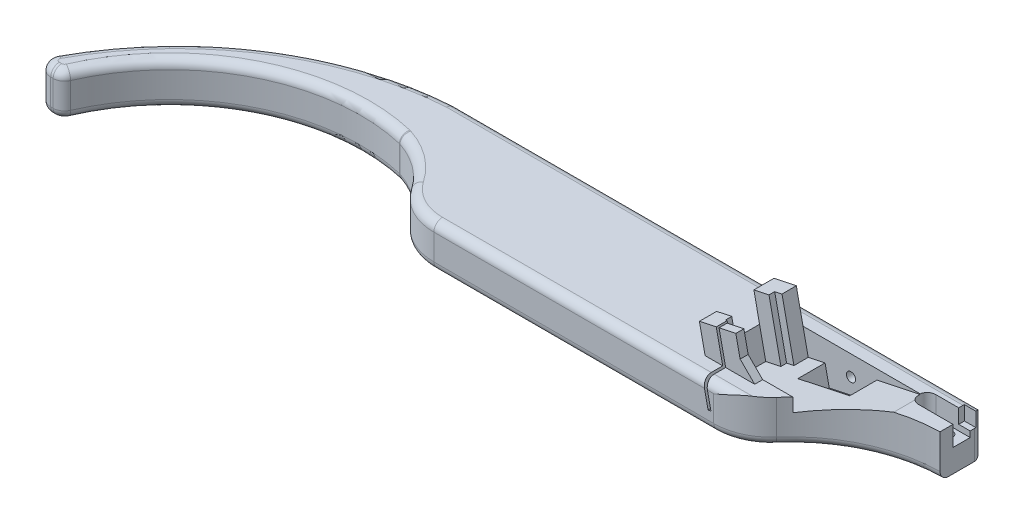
ISO-10303-21;
HEADER;
FILE_DESCRIPTION(('STEP AP214'),'2;1');
FILE_NAME('part.step','',(''),(''),'','','');
FILE_SCHEMA(('AUTOMOTIVE_DESIGN { 1 0 10303 214 1 1 1 1 }'));
ENDSEC;
DATA;
#1=APPLICATION_CONTEXT('core data for automotive mechanical design processes');
#2=APPLICATION_PROTOCOL_DEFINITION('international standard','automotive_design',2000,#1);
#3=PRODUCT_CONTEXT('',#1,'mechanical');
#4=PRODUCT('Part','Part','',(#3));
#5=PRODUCT_RELATED_PRODUCT_CATEGORY('part','',(#4));
#6=PRODUCT_DEFINITION_FORMATION('','',#4);
#7=PRODUCT_DEFINITION_CONTEXT('part definition',#1,'design');
#8=PRODUCT_DEFINITION('design','',#6,#7);
#9=PRODUCT_DEFINITION_SHAPE('','',#8);
#10=(LENGTH_UNIT() NAMED_UNIT(*) SI_UNIT(.MILLI.,.METRE.));
#11=(NAMED_UNIT(*) PLANE_ANGLE_UNIT() SI_UNIT($,.RADIAN.));
#12=(NAMED_UNIT(*) SI_UNIT($,.STERADIAN.) SOLID_ANGLE_UNIT());
#13=UNCERTAINTY_MEASURE_WITH_UNIT(LENGTH_MEASURE(1.E-05),#10,'distance_accuracy_value','');
#14=(GEOMETRIC_REPRESENTATION_CONTEXT(3) GLOBAL_UNCERTAINTY_ASSIGNED_CONTEXT((#13)) GLOBAL_UNIT_ASSIGNED_CONTEXT((#10,
#11,#12)) REPRESENTATION_CONTEXT('',''));
#15=CARTESIAN_POINT('',(0.,0.,0.));
#16=DIRECTION('',(0.,0.,1.));
#17=DIRECTION('',(1.,0.,0.));
#18=AXIS2_PLACEMENT_3D('',#15,#16,#17);
#19=CARTESIAN_POINT('',(-0.5,7.5,0.));
#20=DIRECTION('',(-1.,0.,0.));
#21=DIRECTION('',(0.,0.,1.));
#22=AXIS2_PLACEMENT_3D('',#19,#20,#21);
#23=PLANE('',#22);
#24=DIRECTION('',(0.,0.,1.));
#25=VECTOR('',#24,1.);
#26=CARTESIAN_POINT('',(-0.499999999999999,5.,2.25));
#27=LINE('',#26,#25);
#28=CARTESIAN_POINT('',(-0.499999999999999,5.,1.49999999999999));
#29=VERTEX_POINT('',#28);
#30=CARTESIAN_POINT('',(-0.499999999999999,5.,2.25));
#31=VERTEX_POINT('',#30);
#32=EDGE_CURVE('E1570',#29,#31,#27,.T.);
#33=ORIENTED_EDGE('',*,*,#32,.T.);
#34=DIRECTION('',(0.,-1.,0.));
#35=VECTOR('',#34,1.);
#36=CARTESIAN_POINT('',(-0.5,7.5,2.25));
#37=LINE('',#36,#35);
#38=CARTESIAN_POINT('',(-0.5,4.,2.25));
#39=VERTEX_POINT('',#38);
#40=EDGE_CURVE('E684',#31,#39,#37,.T.);
#41=ORIENTED_EDGE('',*,*,#40,.T.);
#42=DIRECTION('',(0.,0.,-1.));
#43=VECTOR('',#42,1.);
#44=CARTESIAN_POINT('',(-0.5,4.,0.));
#45=LINE('',#44,#43);
#46=CARTESIAN_POINT('',(-0.5,4.,5.25));
#47=VERTEX_POINT('',#46);
#48=EDGE_CURVE('E668',#47,#39,#45,.T.);
#49=ORIENTED_EDGE('',*,*,#48,.F.);
#50=DIRECTION('',(0.,1.,0.));
#51=VECTOR('',#50,1.);
#52=CARTESIAN_POINT('',(-0.499999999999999,7.5,5.25));
#53=LINE('',#52,#51);
#54=CARTESIAN_POINT('',(-0.499999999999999,7.5,5.25));
#55=VERTEX_POINT('',#54);
#56=EDGE_CURVE('E680',#47,#55,#53,.T.);
#57=ORIENTED_EDGE('',*,*,#56,.T.);
#58=DIRECTION('',(0.,0.,-1.));
#59=VECTOR('',#58,1.);
#60=CARTESIAN_POINT('',(-0.5,7.5,0.));
#61=LINE('',#60,#59);
#62=CARTESIAN_POINT('',(-0.499999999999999,7.5,7.50471740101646));
#63=VERTEX_POINT('',#62);
#64=EDGE_CURVE('E892',#63,#55,#61,.T.);
#65=ORIENTED_EDGE('',*,*,#64,.F.);
#66=DIRECTION('',(0.,-1.,0.));
#67=VECTOR('',#66,1.);
#68=CARTESIAN_POINT('',(-0.499999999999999,7.5,7.50471740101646));
#69=LINE('',#68,#67);
#70=CARTESIAN_POINT('',(-0.499999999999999,1.5,7.50471740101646));
#71=VERTEX_POINT('',#70);
#72=EDGE_CURVE('E891',#63,#71,#69,.T.);
#73=ORIENTED_EDGE('',*,*,#72,.T.);
#74=CARTESIAN_POINT('',(-0.499999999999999,1.5,7.50471740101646));
#75=CARTESIAN_POINT('',(-0.499999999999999,1.45780324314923,7.50471712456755));
#76=CARTESIAN_POINT('',(-0.499999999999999,1.41562670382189,7.50293540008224));
#77=CARTESIAN_POINT('',(-0.499999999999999,1.3315754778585,7.4958274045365));
#78=CARTESIAN_POINT('',(-0.499999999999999,1.28970077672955,7.49050130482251));
#79=CARTESIAN_POINT('',(-0.499999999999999,1.16505300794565,7.46925716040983));
#80=CARTESIAN_POINT('',(-0.499999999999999,1.08311495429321,7.44807312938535));
#81=CARTESIAN_POINT('',(-0.499999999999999,0.923960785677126,7.39225049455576));
#82=CARTESIAN_POINT('',(-0.499999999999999,0.846746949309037,7.35760545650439));
#83=CARTESIAN_POINT('',(-0.499999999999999,0.699233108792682,7.27584863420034));
#84=CARTESIAN_POINT('',(-0.499999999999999,0.628931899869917,7.22873902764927));
#85=CARTESIAN_POINT('',(-0.499999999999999,0.497232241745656,7.12338603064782));
#86=CARTESIAN_POINT('',(-0.499999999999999,0.435834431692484,7.06514184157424));
#87=CARTESIAN_POINT('',(-0.499999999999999,0.323673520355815,6.93916006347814));
#88=CARTESIAN_POINT('',(-0.499999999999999,0.272912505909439,6.87142061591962));
#89=CARTESIAN_POINT('',(-0.499999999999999,0.183466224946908,6.72836424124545));
#90=CARTESIAN_POINT('',(-0.499999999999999,0.14478533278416,6.65304458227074));
#91=CARTESIAN_POINT('',(-0.499999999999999,0.08063551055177,6.49699572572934));
#92=CARTESIAN_POINT('',(-0.499999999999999,0.0551588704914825,6.41626971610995));
#93=CARTESIAN_POINT('',(-0.499999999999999,0.0244633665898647,6.27995334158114));
#94=CARTESIAN_POINT('',(-0.499999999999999,0.0152951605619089,6.22521963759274));
#95=CARTESIAN_POINT('',(-0.499999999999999,0.00306427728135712,6.1151531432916));
#96=CARTESIAN_POINT('',(-0.499999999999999,-7.05206715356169E-06,6.05982131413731));
#97=CARTESIAN_POINT('',(-0.499999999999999,0.,6.00446464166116));
#98=B_SPLINE_CURVE_WITH_KNOTS('',3,(#74,#75,#76,#77,#78,#79,#80,#81,#82,#83,#84,#85,#86,#87,#88,
#89,#90,#91,#92,#93,#94,#95,#96,#97),.UNSPECIFIED.,.F.,.F.,(4,2,2,2,2,2,2,2,2,2,2,4),(0.,
0.126512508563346,0.253018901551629,0.50561312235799,0.758328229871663,1.01099921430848,
1.26368832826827,1.51642697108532,1.76925702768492,2.02193928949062,2.18811178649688,
2.35404829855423),.UNSPECIFIED.);
#99=CARTESIAN_POINT('',(-0.499999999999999,0.,6.00446464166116));
#100=VERTEX_POINT('',#99);
#101=EDGE_CURVE('E1004',#71,#100,#98,.T.);
#102=ORIENTED_EDGE('',*,*,#101,.T.);
#103=DIRECTION('',(0.,0.,-1.));
#104=VECTOR('',#103,1.);
#105=CARTESIAN_POINT('',(-0.5,0.,0.));
#106=LINE('',#105,#104);
#107=CARTESIAN_POINT('',(-0.500000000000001,0.,1.49999999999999));
#108=VERTEX_POINT('',#107);
#109=EDGE_CURVE('E887',#100,#108,#106,.T.);
#110=ORIENTED_EDGE('',*,*,#109,.T.);
#111=DIRECTION('',(0.,-1.,0.));
#112=VECTOR('',#111,1.);
#113=CARTESIAN_POINT('',(-0.5,7.5,1.49999999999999));
#114=LINE('',#113,#112);
#115=EDGE_CURVE('E914',#108,#29,#114,.F.);
#116=ORIENTED_EDGE('',*,*,#115,.T.);
#117=EDGE_LOOP('',(#33,#41,#49,#57,#65,#73,#102,#110,#116));
#118=FACE_BOUND('',#117,.T.);
#119=ADVANCED_FACE('F218',(#118),#23,.F.);
#120=CARTESIAN_POINT('',(0.,7.5,34.));
#121=DIRECTION('',(0.,1.,0.));
#122=DIRECTION('',(0.,0.,1.));
#123=AXIS2_PLACEMENT_3D('',#120,#121,#122);
#124=PLANE('',#123);
#125=DIRECTION('',(0.,0.,1.));
#126=VECTOR('',#125,1.);
#127=CARTESIAN_POINT('',(-2.5,7.5,2.25));
#128=LINE('',#127,#126);
#129=CARTESIAN_POINT('',(-2.5,7.5,1.49999999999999));
#130=VERTEX_POINT('',#129);
#131=CARTESIAN_POINT('',(-2.5,7.5,2.25));
#132=VERTEX_POINT('',#131);
#133=EDGE_CURVE('E610',#130,#132,#128,.T.);
#134=ORIENTED_EDGE('',*,*,#133,.F.);
#135=DIRECTION('',(-1.,0.,0.));
#136=VECTOR('',#135,1.);
#137=CARTESIAN_POINT('',(-97.6495718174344,7.5,1.5));
#138=LINE('',#137,#136);
#139=CARTESIAN_POINT('',(-92.6015556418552,7.5,1.5));
#140=VERTEX_POINT('',#139);
#141=EDGE_CURVE('E939',#130,#140,#138,.T.);
#142=ORIENTED_EDGE('',*,*,#141,.T.);
#143=CARTESIAN_POINT('',(-89.3546353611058,7.5,51.7914384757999));
#144=DIRECTION('',(0.,1.,0.));
#145=DIRECTION('',(0.,0.,1.));
#146=AXIS2_PLACEMENT_3D('',#143,#144,#145);
#147=CIRCLE('',#146,50.3961434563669);
#148=CARTESIAN_POINT('',(-133.652916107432,7.5,27.7615904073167));
#149=VERTEX_POINT('',#148);
#150=EDGE_CURVE('E937',#140,#149,#147,.T.);
#151=ORIENTED_EDGE('',*,*,#150,.T.);
#152=CARTESIAN_POINT('',(-133.213415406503,7.5,28.));
#153=DIRECTION('',(0.,1.,0.));
#154=DIRECTION('',(0.,0.,1.));
#155=AXIS2_PLACEMENT_3D('',#152,#153,#154);
#156=CIRCLE('',#155,0.5);
#157=CARTESIAN_POINT('',(-133.213415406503,7.5,28.5));
#158=VERTEX_POINT('',#157);
#159=EDGE_CURVE('E1304',#149,#158,#156,.T.);
#160=ORIENTED_EDGE('',*,*,#159,.T.);
#161=DIRECTION('',(1.,0.,0.));
#162=VECTOR('',#161,1.);
#163=CARTESIAN_POINT('',(-132.79314655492,7.5,28.5));
#164=LINE('',#163,#162);
#165=CARTESIAN_POINT('',(-132.79314655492,7.5,28.5));
#166=VERTEX_POINT('',#165);
#167=EDGE_CURVE('E1307',#158,#166,#164,.T.);
#168=ORIENTED_EDGE('',*,*,#167,.T.);
#169=CARTESIAN_POINT('',(-132.79314655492,7.5,28.));
#170=DIRECTION('',(0.,1.,0.));
#171=DIRECTION('',(0.,0.,1.));
#172=AXIS2_PLACEMENT_3D('',#169,#170,#171);
#173=CIRCLE('',#172,0.5);
#174=CARTESIAN_POINT('',(-132.334573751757,7.5,28.1992761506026));
#175=VERTEX_POINT('',#174);
#176=EDGE_CURVE('E1310',#166,#175,#173,.T.);
#177=ORIENTED_EDGE('',*,*,#176,.T.);
#178=CARTESIAN_POINT('',(-100.371278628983,7.5,42.0891587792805));
#179=DIRECTION('',(0.,1.,0.));
#180=DIRECTION('',(0.,0.,1.));
#181=AXIS2_PLACEMENT_3D('',#178,#179,#180);
#182=CIRCLE('',#181,34.8508403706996);
#183=CARTESIAN_POINT('',(-92.3679206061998,7.5,8.16973462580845));
#184=VERTEX_POINT('',#183);
#185=EDGE_CURVE('E1313',#175,#184,#182,.F.);
#186=ORIENTED_EDGE('',*,*,#185,.T.);
#187=CARTESIAN_POINT('',(-93.056858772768,7.5,11.0895572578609));
#188=DIRECTION('',(0.,1.,0.));
#189=DIRECTION('',(0.,0.,1.));
#190=AXIS2_PLACEMENT_3D('',#187,#188,#189);
#191=CIRCLE('',#190,3.);
#192=CARTESIAN_POINT('',(-92.1162030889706,7.5,8.24084405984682));
#193=VERTEX_POINT('',#192);
#194=EDGE_CURVE('E933',#193,#184,#191,.T.);
#195=ORIENTED_EDGE('',*,*,#194,.F.);
#196=CARTESIAN_POINT('',(-97.5023549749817,7.5,24.5524469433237));
#197=DIRECTION('',(0.,1.,0.));
#198=DIRECTION('',(0.,0.,1.));
#199=AXIS2_PLACEMENT_3D('',#196,#197,#198);
#200=CIRCLE('',#199,17.1778642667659);
#201=CARTESIAN_POINT('',(-83.3494653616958,7.5,14.8172152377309));
#202=VERTEX_POINT('',#201);
#203=EDGE_CURVE('E1301',#193,#202,#200,.F.);
#204=ORIENTED_EDGE('',*,*,#203,.T.);
#205=CARTESIAN_POINT('',(-76.3462919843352,7.5,10.));
#206=DIRECTION('',(0.,1.,0.));
#207=DIRECTION('',(0.,0.,1.));
#208=AXIS2_PLACEMENT_3D('',#205,#206,#207);
#209=CIRCLE('',#208,8.5);
#210=CARTESIAN_POINT('',(-76.3462919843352,7.5,18.5));
#211=VERTEX_POINT('',#210);
#212=EDGE_CURVE('E938',#202,#211,#209,.T.);
#213=ORIENTED_EDGE('',*,*,#212,.T.);
#214=DIRECTION('',(1.,0.,0.));
#215=VECTOR('',#214,1.);
#216=CARTESIAN_POINT('',(-32.5,7.5,18.5));
#217=LINE('',#216,#215);
#218=CARTESIAN_POINT('',(-29.4329782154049,7.5,18.5));
#219=VERTEX_POINT('',#218);
#220=EDGE_CURVE('E934',#211,#219,#217,.T.);
#221=ORIENTED_EDGE('',*,*,#220,.T.);
#222=DIRECTION('',(0.,0.,-1.));
#223=VECTOR('',#222,1.);
#224=CARTESIAN_POINT('',(-29.4329782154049,7.5,16.5));
#225=LINE('',#224,#223);
#226=CARTESIAN_POINT('',(-29.4329782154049,7.5,16.5));
#227=VERTEX_POINT('',#226);
#228=EDGE_CURVE('E730',#219,#227,#225,.T.);
#229=ORIENTED_EDGE('',*,*,#228,.T.);
#230=DIRECTION('',(-1.,0.,0.));
#231=VECTOR('',#230,1.);
#232=CARTESIAN_POINT('',(-22.651236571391,7.5,16.5));
#233=LINE('',#232,#231);
#234=CARTESIAN_POINT('',(-32.5,7.5,16.5));
#235=VERTEX_POINT('',#234);
#236=EDGE_CURVE('E721',#227,#235,#233,.T.);
#237=ORIENTED_EDGE('',*,*,#236,.T.);
#238=DIRECTION('',(0.,0.,-1.));
#239=VECTOR('',#238,1.);
#240=CARTESIAN_POINT('',(-32.5,7.5,30.));
#241=LINE('',#240,#239);
#242=CARTESIAN_POINT('',(-32.5,7.5,13.5));
#243=VERTEX_POINT('',#242);
#244=EDGE_CURVE('E872',#235,#243,#241,.T.);
#245=ORIENTED_EDGE('',*,*,#244,.T.);
#246=CARTESIAN_POINT('',(-32.5,7.5,7.));
#247=VERTEX_POINT('',#246);
#248=EDGE_CURVE('E868',#243,#247,#241,.T.);
#249=ORIENTED_EDGE('',*,*,#248,.T.);
#250=DIRECTION('',(0.,0.,-1.));
#251=VECTOR('',#250,1.);
#252=CARTESIAN_POINT('',(-32.5,7.5,34.));
#253=LINE('',#252,#251);
#254=CARTESIAN_POINT('',(-32.5,7.5,3.5));
#255=VERTEX_POINT('',#254);
#256=EDGE_CURVE('E809',#247,#255,#253,.T.);
#257=ORIENTED_EDGE('',*,*,#256,.T.);
#258=DIRECTION('',(1.,0.,0.));
#259=VECTOR('',#258,1.);
#260=CARTESIAN_POINT('',(-7.5,7.5,3.5));
#261=LINE('',#260,#259);
#262=CARTESIAN_POINT('',(-28.4106376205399,7.5,3.5));
#263=VERTEX_POINT('',#262);
#264=EDGE_CURVE('E859',#255,#263,#261,.T.);
#265=ORIENTED_EDGE('',*,*,#264,.T.);
#266=CARTESIAN_POINT('',(-7.97901994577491,7.5,3.5));
#267=VERTEX_POINT('',#266);
#268=EDGE_CURVE('E863',#263,#267,#261,.T.);
#269=ORIENTED_EDGE('',*,*,#268,.T.);
#270=CARTESIAN_POINT('',(-6.5,7.5,3.75));
#271=DIRECTION('',(0.,1.,0.));
#272=DIRECTION('',(0.,0.,1.));
#273=AXIS2_PLACEMENT_3D('',#270,#271,#272);
#274=CIRCLE('',#273,1.5);
#275=CARTESIAN_POINT('',(-6.5,7.5,2.25));
#276=VERTEX_POINT('',#275);
#277=EDGE_CURVE('E638',#276,#267,#274,.T.);
#278=ORIENTED_EDGE('',*,*,#277,.F.);
#279=DIRECTION('',(-1.,0.,0.));
#280=VECTOR('',#279,1.);
#281=CARTESIAN_POINT('',(-6.5,7.5,2.25));
#282=LINE('',#281,#280);
#283=EDGE_CURVE('E628',#132,#276,#282,.T.);
#284=ORIENTED_EDGE('',*,*,#283,.F.);
#285=EDGE_LOOP('',(#134,#142,#151,#160,#168,#177,#186,#195,#204,#213,#221,#229,#237,#245,#249,
#257,#265,#269,#278,#284));
#286=FACE_BOUND('',#285,.T.);
#287=ADVANCED_FACE('F636',(#286),#124,.T.);
#288=CARTESIAN_POINT('',(-3.,5.5,3.75));
#289=DIRECTION('',(0.,1.,0.));
#290=DIRECTION('',(0.,0.,1.));
#291=AXIS2_PLACEMENT_3D('',#288,#289,#290);
#292=CYLINDRICAL_SURFACE('',#291,0.95);
#293=CARTESIAN_POINT('',(-3.,0.,3.75));
#294=DIRECTION('',(0.,1.,0.));
#295=DIRECTION('',(0.,0.,1.));
#296=AXIS2_PLACEMENT_3D('',#293,#294,#295);
#297=CIRCLE('',#296,0.950000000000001);
#298=CARTESIAN_POINT('',(-3.,0.,4.7));
#299=VERTEX_POINT('',#298);
#300=EDGE_CURVE('E687',#299,#299,#297,.T.);
#301=ORIENTED_EDGE('',*,*,#300,.F.);
#302=EDGE_LOOP('',(#301));
#303=FACE_BOUND('',#302,.T.);
#304=CARTESIAN_POINT('',(-3.,4.,3.75));
#305=DIRECTION('',(0.,1.,0.));
#306=DIRECTION('',(0.,0.,1.));
#307=AXIS2_PLACEMENT_3D('',#304,#305,#306);
#308=CIRCLE('',#307,0.95);
#309=CARTESIAN_POINT('',(-3.,4.,4.7));
#310=VERTEX_POINT('',#309);
#311=EDGE_CURVE('E664',#310,#310,#308,.F.);
#312=ORIENTED_EDGE('',*,*,#311,.F.);
#313=EDGE_LOOP('',(#312));
#314=FACE_BOUND('',#313,.T.);
#315=ADVANCED_FACE('F1709',(#303,#314),#292,.F.);
#316=CARTESIAN_POINT('',(-5.5,5.5,3.75));
#317=DIRECTION('',(0.,1.,0.));
#318=DIRECTION('',(0.,0.,1.));
#319=AXIS2_PLACEMENT_3D('',#316,#317,#318);
#320=CYLINDRICAL_SURFACE('',#319,0.95);
#321=CARTESIAN_POINT('',(-5.5,0.,3.75));
#322=DIRECTION('',(0.,1.,0.));
#323=DIRECTION('',(0.,0.,1.));
#324=AXIS2_PLACEMENT_3D('',#321,#322,#323);
#325=CIRCLE('',#324,0.95);
#326=CARTESIAN_POINT('',(-5.5,0.,4.7));
#327=VERTEX_POINT('',#326);
#328=EDGE_CURVE('E693',#327,#327,#325,.T.);
#329=ORIENTED_EDGE('',*,*,#328,.F.);
#330=EDGE_LOOP('',(#329));
#331=FACE_BOUND('',#330,.T.);
#332=CARTESIAN_POINT('',(-5.5,4.,3.75));
#333=DIRECTION('',(0.,1.,0.));
#334=DIRECTION('',(0.,0.,1.));
#335=AXIS2_PLACEMENT_3D('',#332,#333,#334);
#336=CIRCLE('',#335,0.95);
#337=CARTESIAN_POINT('',(-5.5,4.,4.7));
#338=VERTEX_POINT('',#337);
#339=EDGE_CURVE('E660',#338,#338,#336,.F.);
#340=ORIENTED_EDGE('',*,*,#339,.F.);
#341=EDGE_LOOP('',(#340));
#342=FACE_BOUND('',#341,.T.);
#343=ADVANCED_FACE('F1703',(#331,#342),#320,.F.);
#344=CARTESIAN_POINT('',(-87.5,7.5,20.));
#345=DIRECTION('',(0.,0.,-1.));
#346=DIRECTION('',(-1.,0.,0.));
#347=AXIS2_PLACEMENT_3D('',#344,#345,#346);
#348=PLANE('',#347);
#349=DIRECTION('',(0.,-1.,0.));
#350=VECTOR('',#349,1.);
#351=CARTESIAN_POINT('',(-27.5,7.5,20.));
#352=LINE('',#351,#350);
#353=CARTESIAN_POINT('',(-27.5,1.5,20.));
#354=VERTEX_POINT('',#353);
#355=CARTESIAN_POINT('',(-27.5,6.,20.));
#356=VERTEX_POINT('',#355);
#357=EDGE_CURVE('E893',#354,#356,#352,.F.);
#358=ORIENTED_EDGE('',*,*,#357,.T.);
#359=DIRECTION('',(-1.,0.,0.));
#360=VECTOR('',#359,1.);
#361=CARTESIAN_POINT('',(-13.6029730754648,5.99999999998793,20.));
#362=LINE('',#361,#360);
#363=CARTESIAN_POINT('',(-28.6029730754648,5.99999999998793,20.));
#364=VERTEX_POINT('',#363);
#365=EDGE_CURVE('E715',#356,#364,#362,.T.);
#366=ORIENTED_EDGE('',*,*,#365,.T.);
#367=DIRECTION('',(-0.207911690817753,0.978147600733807,0.));
#368=VECTOR('',#367,1.);
#369=CARTESIAN_POINT('',(-30.0749185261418,12.9249588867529,20.));
#370=LINE('',#369,#368);
#371=CARTESIAN_POINT('',(-27.9958016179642,3.14348287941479,20.));
#372=VERTEX_POINT('',#371);
#373=EDGE_CURVE('E700',#372,#364,#370,.T.);
#374=ORIENTED_EDGE('',*,*,#373,.F.);
#375=DIRECTION('',(-0.978147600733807,-0.207911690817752,0.));
#376=VECTOR('',#375,1.);
#377=CARTESIAN_POINT('',(-84.0418183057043,-8.7694657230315,20.));
#378=LINE('',#377,#376);
#379=CARTESIAN_POINT('',(-28.4848754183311,3.03952703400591,20.));
#380=VERTEX_POINT('',#379);
#381=EDGE_CURVE('E884',#372,#380,#378,.T.);
#382=ORIENTED_EDGE('',*,*,#381,.T.);
#383=DIRECTION('',(-0.207911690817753,0.978147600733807,0.));
#384=VECTOR('',#383,1.);
#385=CARTESIAN_POINT('',(-28.8347695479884,4.6856494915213,20.));
#386=LINE('',#385,#384);
#387=CARTESIAN_POINT('',(-29.1141433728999,5.99999999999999,20.));
#388=VERTEX_POINT('',#387);
#389=EDGE_CURVE('E722',#380,#388,#386,.T.);
#390=ORIENTED_EDGE('',*,*,#389,.T.);
#391=DIRECTION('',(1.,0.,0.));
#392=VECTOR('',#391,1.);
#393=CARTESIAN_POINT('',(-81.3462919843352,6.,20.));
#394=LINE('',#393,#392);
#395=CARTESIAN_POINT('',(-76.3462919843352,6.,20.));
#396=VERTEX_POINT('',#395);
#397=EDGE_CURVE('E945',#388,#396,#394,.F.);
#398=ORIENTED_EDGE('',*,*,#397,.T.);
#399=DIRECTION('',(0.,-1.,0.));
#400=VECTOR('',#399,1.);
#401=CARTESIAN_POINT('',(-76.3462919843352,7.5,20.));
#402=LINE('',#401,#400);
#403=CARTESIAN_POINT('',(-76.3462919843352,1.5,20.));
#404=VERTEX_POINT('',#403);
#405=EDGE_CURVE('E896',#396,#404,#402,.T.);
#406=ORIENTED_EDGE('',*,*,#405,.T.);
#407=DIRECTION('',(1.,0.,0.));
#408=VECTOR('',#407,1.);
#409=CARTESIAN_POINT('',(-87.5,1.5,20.));
#410=LINE('',#409,#408);
#411=EDGE_CURVE('E942',#404,#354,#410,.T.);
#412=ORIENTED_EDGE('',*,*,#411,.T.);
#413=EDGE_LOOP('',(#358,#366,#374,#382,#390,#398,#406,#412));
#414=FACE_BOUND('',#413,.T.);
#415=ADVANCED_FACE('F1693',(#414),#348,.F.);
#416=CARTESIAN_POINT('',(-13.9218079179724,6.,18.5));
#417=DIRECTION('',(-1.,0.,0.));
#418=DIRECTION('',(0.,0.,1.));
#419=AXIS2_PLACEMENT_3D('',#416,#417,#418);
#420=CYLINDRICAL_SURFACE('',#419,1.5);
#421=CARTESIAN_POINT('',(-22.2321731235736,7.5,18.5));
#422=CARTESIAN_POINT('',(-22.3044118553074,7.49998912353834,18.5447723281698));
#423=CARTESIAN_POINT('',(-22.3772065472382,7.49799601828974,18.5886091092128));
#424=CARTESIAN_POINT('',(-22.5237216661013,7.49045974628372,18.6743208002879));
#425=CARTESIAN_POINT('',(-22.5974416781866,7.48491811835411,18.7161965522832));
#426=CARTESIAN_POINT('',(-22.7455190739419,7.47071430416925,18.7978433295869));
#427=CARTESIAN_POINT('',(-22.8198746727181,7.46205909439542,18.8376188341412));
#428=CARTESIAN_POINT('',(-22.9692727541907,7.44196652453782,18.9151329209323));
#429=CARTESIAN_POINT('',(-23.0443153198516,7.43052882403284,18.9528712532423));
#430=CARTESIAN_POINT('',(-23.2694568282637,7.39265185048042,19.062574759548));
#431=CARTESIAN_POINT('',(-23.4204373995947,7.36255812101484,19.1315060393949));
#432=CARTESIAN_POINT('',(-23.7241952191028,7.29455519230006,19.2612426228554));
#433=CARTESIAN_POINT('',(-23.876973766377,7.25663996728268,19.3220416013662));
#434=CARTESIAN_POINT('',(-24.2775654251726,7.14951632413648,19.4702343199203));
#435=CARTESIAN_POINT('',(-24.5264474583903,7.07533604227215,19.5511998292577));
#436=CARTESIAN_POINT('',(-25.0264160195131,6.91584307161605,19.6927265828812));
#437=CARTESIAN_POINT('',(-25.2775033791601,6.83052599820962,19.7532797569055));
#438=CARTESIAN_POINT('',(-25.7814624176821,6.65239549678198,19.8545821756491));
#439=CARTESIAN_POINT('',(-26.0343363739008,6.55956980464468,19.8952982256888));
#440=CARTESIAN_POINT('',(-26.5407414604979,6.36969423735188,19.9571513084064));
#441=CARTESIAN_POINT('',(-26.7942722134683,6.27264642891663,19.9782978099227));
#442=CARTESIAN_POINT('',(-27.1923680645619,6.11913450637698,19.9963125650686));
#443=CARTESIAN_POINT('',(-27.336862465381,6.06318244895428,19.9997131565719));
#444=CARTESIAN_POINT('',(-27.4875666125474,6.00481543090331,19.9999942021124));
#445=CARTESIAN_POINT('',(-27.4937833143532,6.00240771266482,19.9999999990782));
#446=CARTESIAN_POINT('',(-27.5,6.,20.));
#447=B_SPLINE_CURVE_WITH_KNOTS('',3,(#421,#422,#423,#424,#425,#426,#427,#428,#429,#430,#431,
#432,#433,#434,#435,#436,#437,#438,#439,#440,#441,#442,#443,#444,#445,#446),.UNSPECIFIED.,.F.,
.F.,(4,2,2,2,2,2,2,2,2,2,2,2,4),(0.,0.254905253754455,0.509700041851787,0.763927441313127,
1.01818595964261,1.52372729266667,2.02965956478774,2.84450522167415,3.65967266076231,
4.47619952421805,5.29233109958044,5.75716660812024,5.77716661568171),.UNSPECIFIED.);
#448=CARTESIAN_POINT('',(-22.2321731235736,7.5,18.5));
#449=VERTEX_POINT('',#448);
#450=EDGE_CURVE('E968',#449,#356,#447,.T.);
#451=ORIENTED_EDGE('',*,*,#450,.F.);
#452=DIRECTION('',(-1.,0.,0.));
#453=VECTOR('',#452,1.);
#454=CARTESIAN_POINT('',(-13.9218079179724,7.5,18.5));
#455=LINE('',#454,#453);
#456=CARTESIAN_POINT('',(-28.9218079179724,7.5,18.5));
#457=VERTEX_POINT('',#456);
#458=EDGE_CURVE('E711',#449,#457,#455,.T.);
#459=ORIENTED_EDGE('',*,*,#458,.T.);
#460=CARTESIAN_POINT('',(-28.9218079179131,7.5,18.5));
#461=CARTESIAN_POINT('',(-28.9218079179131,7.5,19.3786796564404));
#462=CARTESIAN_POINT('',(-28.7897422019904,6.87867965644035,20.));
#463=CARTESIAN_POINT('',(-28.602973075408,5.99999999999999,20.));
#464=(BOUNDED_CURVE() B_SPLINE_CURVE(3,(#460,#461,#462,#463),.UNSPECIFIED.,.F.,
.F.) B_SPLINE_CURVE_WITH_KNOTS((4,4),(0.,1.),
.UNSPECIFIED.) CURVE() GEOMETRIC_REPRESENTATION_ITEM() RATIONAL_B_SPLINE_CURVE((1.,
0.804737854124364,0.804737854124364,1.)) REPRESENTATION_ITEM(''));
#465=EDGE_CURVE('E694',#457,#364,#464,.T.);
#466=ORIENTED_EDGE('',*,*,#465,.T.);
#467=ORIENTED_EDGE('',*,*,#365,.F.);
#468=EDGE_LOOP('',(#451,#459,#466,#467));
#469=FACE_BOUND('',#468,.T.);
#470=ADVANCED_FACE('F981',(#469),#420,.T.);
#471=CARTESIAN_POINT('',(-31.4193182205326,2.41579196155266,30.));
#472=DIRECTION('',(0.207911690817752,-0.978147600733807,0.));
#473=DIRECTION('',(0.978147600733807,0.207911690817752,0.));
#474=AXIS2_PLACEMENT_3D('',#471,#472,#473);
#475=PLANE('',#474);
#476=DIRECTION('',(0.,0.,-1.));
#477=VECTOR('',#476,1.);
#478=CARTESIAN_POINT('',(-7.5,7.5,30.));
#479=LINE('',#478,#477);
#480=CARTESIAN_POINT('',(-7.5,7.5,8.58346994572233));
#481=VERTEX_POINT('',#480);
#482=CARTESIAN_POINT('',(-7.5,7.5,4.8680339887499));
#483=VERTEX_POINT('',#482);
#484=EDGE_CURVE('E867',#481,#483,#479,.T.);
#485=ORIENTED_EDGE('',*,*,#484,.T.);
#486=CARTESIAN_POINT('',(-6.5,7.71255656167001,3.75));
#487=DIRECTION('',(0.207911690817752,-0.978147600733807,0.));
#488=DIRECTION('',(0.978147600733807,0.207911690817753,0.));
#489=AXIS2_PLACEMENT_3D('',#486,#487,#488);
#490=ELLIPSE('',#489,1.53351089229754,1.5);
#491=CARTESIAN_POINT('',(-7.97901994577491,7.39818116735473,3.5));
#492=VERTEX_POINT('',#491);
#493=EDGE_CURVE('E676',#483,#492,#490,.T.);
#494=ORIENTED_EDGE('',*,*,#493,.T.);
#495=DIRECTION('',(-0.978147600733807,-0.207911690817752,0.));
#496=VECTOR('',#495,1.);
#497=CARTESIAN_POINT('',(-31.4193182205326,2.41579196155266,3.5));
#498=LINE('',#497,#496);
#499=CARTESIAN_POINT('',(-15.5244197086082,5.79435693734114,3.5));
#500=VERTEX_POINT('',#499);
#501=EDGE_CURVE('E864',#492,#500,#498,.T.);
#502=ORIENTED_EDGE('',*,*,#501,.T.);
#503=DIRECTION('',(0.,0.,-1.));
#504=VECTOR('',#503,1.);
#505=CARTESIAN_POINT('',(-15.5244197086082,5.79435693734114,30.));
#506=LINE('',#505,#504);
#507=CARTESIAN_POINT('',(-15.5244197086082,5.79435693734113,8.25));
#508=VERTEX_POINT('',#507);
#509=EDGE_CURVE('E777',#508,#500,#506,.T.);
#510=ORIENTED_EDGE('',*,*,#509,.F.);
#511=DIRECTION('',(0.978147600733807,0.207911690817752,0.));
#512=VECTOR('',#511,1.);
#513=CARTESIAN_POINT('',(-31.4193182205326,2.41579196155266,8.25));
#514=LINE('',#513,#512);
#515=CARTESIAN_POINT('',(-24.5722850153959,3.87117379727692,8.25));
#516=VERTEX_POINT('',#515);
#517=EDGE_CURVE('E906',#516,#508,#514,.T.);
#518=ORIENTED_EDGE('',*,*,#517,.F.);
#519=DIRECTION('',(0.,0.,1.));
#520=VECTOR('',#519,1.);
#521=CARTESIAN_POINT('',(-24.5722850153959,3.87117379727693,30.));
#522=LINE('',#521,#520);
#523=CARTESIAN_POINT('',(-24.5722850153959,3.87117379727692,3.5));
#524=VERTEX_POINT('',#523);
#525=EDGE_CURVE('E781',#524,#516,#522,.T.);
#526=ORIENTED_EDGE('',*,*,#525,.F.);
#527=CARTESIAN_POINT('',(-27.5067278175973,3.24743872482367,3.5));
#528=VERTEX_POINT('',#527);
#529=EDGE_CURVE('E862',#524,#528,#498,.T.);
#530=ORIENTED_EDGE('',*,*,#529,.T.);
#531=DIRECTION('',(0.,0.,-1.));
#532=VECTOR('',#531,1.);
#533=CARTESIAN_POINT('',(-27.5067278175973,3.24743872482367,5.));
#534=LINE('',#533,#532);
#535=CARTESIAN_POINT('',(-27.5067278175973,3.24743872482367,6.));
#536=VERTEX_POINT('',#535);
#537=EDGE_CURVE('E794',#536,#528,#534,.T.);
#538=ORIENTED_EDGE('',*,*,#537,.F.);
#539=DIRECTION('',(0.978147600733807,0.207911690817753,0.));
#540=VECTOR('',#539,1.);
#541=CARTESIAN_POINT('',(-28.973949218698,2.93557118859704,6.));
#542=LINE('',#541,#540);
#543=CARTESIAN_POINT('',(-28.7783196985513,2.97715352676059,6.));
#544=VERTEX_POINT('',#543);
#545=EDGE_CURVE('E234',#544,#536,#542,.T.);
#546=ORIENTED_EDGE('',*,*,#545,.F.);
#547=DIRECTION('',(0.,0.,-1.));
#548=VECTOR('',#547,1.);
#549=CARTESIAN_POINT('',(-28.7783196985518,2.97715352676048,30.0000000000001));
#550=LINE('',#549,#548);
#551=CARTESIAN_POINT('',(-28.7783196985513,2.97715352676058,7.));
#552=VERTEX_POINT('',#551);
#553=EDGE_CURVE('E813',#552,#544,#550,.T.);
#554=ORIENTED_EDGE('',*,*,#553,.F.);
#555=DIRECTION('',(0.978147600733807,0.207911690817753,0.));
#556=VECTOR('',#555,1.);
#557=CARTESIAN_POINT('',(-31.4193182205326,2.41579196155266,7.));
#558=LINE('',#557,#556);
#559=CARTESIAN_POINT('',(-31.4193182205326,2.41579196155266,7.));
#560=VERTEX_POINT('',#559);
#561=EDGE_CURVE('E798',#560,#552,#558,.T.);
#562=ORIENTED_EDGE('',*,*,#561,.F.);
#563=DIRECTION('',(0.,0.,-1.));
#564=VECTOR('',#563,1.);
#565=CARTESIAN_POINT('',(-31.4193182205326,2.41579196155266,30.));
#566=LINE('',#565,#564);
#567=CARTESIAN_POINT('',(-31.4193182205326,2.41579196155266,13.5));
#568=VERTEX_POINT('',#567);
#569=EDGE_CURVE('E873',#568,#560,#566,.T.);
#570=ORIENTED_EDGE('',*,*,#569,.F.);
#571=DIRECTION('',(-0.978147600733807,-0.207911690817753,0.));
#572=VECTOR('',#571,1.);
#573=CARTESIAN_POINT('',(-31.4193182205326,2.41579196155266,13.5));
#574=LINE('',#573,#572);
#575=CARTESIAN_POINT('',(-28.7783196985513,2.97715352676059,13.5));
#576=VERTEX_POINT('',#575);
#577=EDGE_CURVE('E841',#576,#568,#574,.T.);
#578=ORIENTED_EDGE('',*,*,#577,.F.);
#579=DIRECTION('',(0.,0.,-1.));
#580=VECTOR('',#579,1.);
#581=CARTESIAN_POINT('',(-28.778319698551,2.97715352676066,30.));
#582=LINE('',#581,#580);
#583=CARTESIAN_POINT('',(-28.7783196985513,2.97715352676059,14.6));
#584=VERTEX_POINT('',#583);
#585=EDGE_CURVE('E1167',#584,#576,#582,.T.);
#586=ORIENTED_EDGE('',*,*,#585,.F.);
#587=DIRECTION('',(-0.978147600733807,-0.207911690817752,0.));
#588=VECTOR('',#587,1.);
#589=CARTESIAN_POINT('',(-31.4193182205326,2.41579196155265,14.6));
#590=LINE('',#589,#588);
#591=CARTESIAN_POINT('',(-28.4848754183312,3.03952703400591,14.6));
#592=VERTEX_POINT('',#591);
#593=EDGE_CURVE('E829',#592,#584,#590,.T.);
#594=ORIENTED_EDGE('',*,*,#593,.F.);
#595=DIRECTION('',(0.,0.,-1.));
#596=VECTOR('',#595,1.);
#597=CARTESIAN_POINT('',(-28.4848754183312,3.03952703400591,15.));
#598=LINE('',#597,#596);
#599=EDGE_CURVE('E824',#380,#592,#598,.T.);
#600=ORIENTED_EDGE('',*,*,#599,.F.);
#601=ORIENTED_EDGE('',*,*,#381,.F.);
#602=DIRECTION('',(0.,0.,1.));
#603=VECTOR('',#602,1.);
#604=CARTESIAN_POINT('',(-27.9958016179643,3.14348287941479,16.5));
#605=LINE('',#604,#603);
#606=CARTESIAN_POINT('',(-27.9958016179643,3.14348287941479,15.1));
#607=VERTEX_POINT('',#606);
#608=EDGE_CURVE('E847',#607,#372,#605,.T.);
#609=ORIENTED_EDGE('',*,*,#608,.F.);
#610=DIRECTION('',(-0.978147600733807,-0.207911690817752,0.));
#611=VECTOR('',#610,1.);
#612=CARTESIAN_POINT('',(-31.4193182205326,2.41579196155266,15.1));
#613=LINE('',#612,#611);
#614=CARTESIAN_POINT('',(-18.5752523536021,5.1458824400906,15.1));
#615=VERTEX_POINT('',#614);
#616=EDGE_CURVE('E828',#615,#607,#613,.T.);
#617=ORIENTED_EDGE('',*,*,#616,.F.);
#618=CARTESIAN_POINT('',(0.,9.09417421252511,34.));
#619=DIRECTION('',(0.207911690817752,-0.978147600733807,0.));
#620=DIRECTION('',(-0.978147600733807,-0.207911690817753,0.));
#621=AXIS2_PLACEMENT_3D('',#618,#619,#620);
#622=ELLIPSE('',#621,27.0920257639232,26.5);
#623=EDGE_CURVE('E880',#481,#615,#622,.F.);
#624=ORIENTED_EDGE('',*,*,#623,.F.);
#625=EDGE_LOOP('',(#485,#494,#502,#510,#518,#526,#530,#538,#546,#554,#562,#570,#578,#586,#594,
#600,#601,#609,#617,#624));
#626=FACE_BOUND('',#625,.T.);
#627=ADVANCED_FACE('F1532',(#626),#475,.F.);
#628=CARTESIAN_POINT('',(-30.5639923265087,12.821003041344,16.5));
#629=DIRECTION('',(0.,0.,-1.));
#630=DIRECTION('',(-1.,0.,0.));
#631=AXIS2_PLACEMENT_3D('',#628,#629,#630);
#632=PLANE('',#631);
#633=ORIENTED_EDGE('',*,*,#236,.F.);
#634=DIRECTION('',(0.207911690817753,-0.978147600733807,0.));
#635=VECTOR('',#634,1.);
#636=CARTESIAN_POINT('',(-30.5639923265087,12.821003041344,16.5));
#637=LINE('',#636,#635);
#638=CARTESIAN_POINT('',(-30.5639923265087,12.821003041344,16.5));
#639=VERTEX_POINT('',#638);
#640=EDGE_CURVE('E812',#639,#227,#637,.T.);
#641=ORIENTED_EDGE('',*,*,#640,.F.);
#642=DIRECTION('',(0.978147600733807,0.207911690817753,0.));
#643=VECTOR('',#642,1.);
#644=CARTESIAN_POINT('',(-30.5639923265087,12.821003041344,16.5));
#645=LINE('',#644,#643);
#646=CARTESIAN_POINT('',(-33.4984351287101,12.1972679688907,16.5));
#647=VERTEX_POINT('',#646);
#648=EDGE_CURVE('E836',#647,#639,#645,.T.);
#649=ORIENTED_EDGE('',*,*,#648,.F.);
#650=DIRECTION('',(0.207911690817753,-0.978147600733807,0.));
#651=VECTOR('',#650,1.);
#652=CARTESIAN_POINT('',(-33.4984351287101,12.1972679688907,16.5));
#653=LINE('',#652,#651);
#654=EDGE_CURVE('E818',#647,#235,#653,.T.);
#655=ORIENTED_EDGE('',*,*,#654,.T.);
#656=EDGE_LOOP('',(#633,#641,#649,#655));
#657=FACE_BOUND('',#656,.T.);
#658=ADVANCED_FACE('F1700',(#657),#632,.F.);
#659=CARTESIAN_POINT('',(-31.4193182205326,2.41579196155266,30.));
#660=DIRECTION('',(-0.978147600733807,-0.207911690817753,0.));
#661=DIRECTION('',(0.207911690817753,-0.978147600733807,0.));
#662=AXIS2_PLACEMENT_3D('',#659,#660,#661);
#663=PLANE('',#662);
#664=DIRECTION('',(0.207911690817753,-0.978147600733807,0.));
#665=VECTOR('',#664,1.);
#666=CARTESIAN_POINT('',(-33.4984351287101,12.1972679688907,7.));
#667=LINE('',#666,#665);
#668=EDGE_CURVE('E793',#247,#560,#667,.T.);
#669=ORIENTED_EDGE('',*,*,#668,.F.);
#670=ORIENTED_EDGE('',*,*,#248,.F.);
#671=DIRECTION('',(-0.207911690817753,0.978147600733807,0.));
#672=VECTOR('',#671,1.);
#673=CARTESIAN_POINT('',(-31.4193182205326,2.41579196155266,13.5));
#674=LINE('',#673,#672);
#675=EDGE_CURVE('E907',#568,#243,#674,.T.);
#676=ORIENTED_EDGE('',*,*,#675,.F.);
#677=ORIENTED_EDGE('',*,*,#569,.T.);
#678=EDGE_LOOP('',(#669,#670,#676,#677));
#679=FACE_BOUND('',#678,.T.);
#680=ADVANCED_FACE('F1720',(#679),#663,.F.);
#681=CARTESIAN_POINT('',(0.,0.,3.5));
#682=DIRECTION('',(0.,0.,-1.));
#683=DIRECTION('',(-1.,0.,0.));
#684=AXIS2_PLACEMENT_3D('',#681,#682,#683);
#685=PLANE('',#684);
#686=CARTESIAN_POINT('',(-20.0483523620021,4.,3.5));
#687=DIRECTION('',(0.,0.,1.));
#688=DIRECTION('',(1.,0.,0.));
#689=AXIS2_PLACEMENT_3D('',#686,#687,#688);
#690=CIRCLE('',#689,0.80000000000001);
#691=CARTESIAN_POINT('',(-19.2483523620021,4.,3.5));
#692=VERTEX_POINT('',#691);
#693=EDGE_CURVE('E733',#692,#692,#690,.T.);
#694=ORIENTED_EDGE('',*,*,#693,.F.);
#695=EDGE_LOOP('',(#694));
#696=FACE_BOUND('',#695,.T.);
#697=ORIENTED_EDGE('',*,*,#501,.F.);
#698=DIRECTION('',(0.,1.,0.));
#699=VECTOR('',#698,1.);
#700=CARTESIAN_POINT('',(-7.97901994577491,4.,3.5));
#701=LINE('',#700,#699);
#702=EDGE_CURVE('E672',#492,#267,#701,.T.);
#703=ORIENTED_EDGE('',*,*,#702,.T.);
#704=ORIENTED_EDGE('',*,*,#268,.F.);
#705=DIRECTION('',(-0.207911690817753,0.978147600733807,0.));
#706=VECTOR('',#705,1.);
#707=CARTESIAN_POINT('',(-25.6572608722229,-5.45361915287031,3.5));
#708=LINE('',#707,#706);
#709=EDGE_CURVE('E902',#528,#263,#708,.T.);
#710=ORIENTED_EDGE('',*,*,#709,.F.);
#711=ORIENTED_EDGE('',*,*,#529,.F.);
#712=DIRECTION('',(0.207911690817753,-0.978147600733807,0.));
#713=VECTOR('',#712,1.);
#714=CARTESIAN_POINT('',(-31.4335299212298,36.1507931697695,3.5));
#715=LINE('',#714,#713);
#716=CARTESIAN_POINT('',(-23.8445940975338,0.447657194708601,3.5));
#717=VERTEX_POINT('',#716);
#718=EDGE_CURVE('E765',#524,#717,#715,.T.);
#719=ORIENTED_EDGE('',*,*,#718,.T.);
#720=DIRECTION('',(-0.978147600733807,-0.207911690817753,0.));
#721=VECTOR('',#720,1.);
#722=CARTESIAN_POINT('',(-23.8445940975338,0.447657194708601,3.5));
#723=LINE('',#722,#721);
#724=CARTESIAN_POINT('',(-14.7967287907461,2.37084033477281,3.5));
#725=VERTEX_POINT('',#724);
#726=EDGE_CURVE('E761',#725,#717,#723,.T.);
#727=ORIENTED_EDGE('',*,*,#726,.F.);
#728=DIRECTION('',(0.207911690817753,-0.978147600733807,0.));
#729=VECTOR('',#728,1.);
#730=CARTESIAN_POINT('',(-22.385664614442,38.0739763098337,3.5));
#731=LINE('',#730,#729);
#732=EDGE_CURVE('E768',#500,#725,#731,.T.);
#733=ORIENTED_EDGE('',*,*,#732,.F.);
#734=EDGE_LOOP('',(#697,#703,#704,#710,#711,#719,#727,#733));
#735=FACE_BOUND('',#734,.T.);
#736=ADVANCED_FACE('F1527',(#696,#735),#685,.F.);
#737=CARTESIAN_POINT('',(-87.5,7.5,0.));
#738=DIRECTION('',(0.,0.,1.));
#739=DIRECTION('',(1.,0.,0.));
#740=AXIS2_PLACEMENT_3D('',#737,#738,#739);
#741=PLANE('',#740);
#742=DIRECTION('',(-1.,0.,0.));
#743=VECTOR('',#742,1.);
#744=CARTESIAN_POINT('',(0.,6.,0.));
#745=LINE('',#744,#743);
#746=CARTESIAN_POINT('',(-92.6015556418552,6.,0.));
#747=VERTEX_POINT('',#746);
#748=CARTESIAN_POINT('',(-20.0483523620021,6.,0.));
#749=VERTEX_POINT('',#748);
#750=EDGE_CURVE('E954',#747,#749,#745,.F.);
#751=ORIENTED_EDGE('',*,*,#750,.T.);
#752=CARTESIAN_POINT('',(-20.0483523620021,4.,0.));
#753=DIRECTION('',(0.,0.,1.));
#754=DIRECTION('',(1.,0.,0.));
#755=AXIS2_PLACEMENT_3D('',#752,#753,#754);
#756=CIRCLE('',#755,2.);
#757=EDGE_CURVE('E743',#749,#749,#756,.T.);
#758=ORIENTED_EDGE('',*,*,#757,.T.);
#759=CARTESIAN_POINT('',(-2.,6.,0.));
#760=VERTEX_POINT('',#759);
#761=EDGE_CURVE('E959',#749,#760,#745,.F.);
#762=ORIENTED_EDGE('',*,*,#761,.T.);
#763=DIRECTION('',(0.,-1.,0.));
#764=VECTOR('',#763,1.);
#765=CARTESIAN_POINT('',(-2.,7.5,0.));
#766=LINE('',#765,#764);
#767=CARTESIAN_POINT('',(-2.,1.5,0.));
#768=VERTEX_POINT('',#767);
#769=EDGE_CURVE('E958',#760,#768,#766,.T.);
#770=ORIENTED_EDGE('',*,*,#769,.T.);
#771=DIRECTION('',(-1.,0.,0.));
#772=VECTOR('',#771,1.);
#773=CARTESIAN_POINT('',(-87.5,1.5,0.));
#774=LINE('',#773,#772);
#775=CARTESIAN_POINT('',(-92.6015556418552,1.5,0.));
#776=VERTEX_POINT('',#775);
#777=EDGE_CURVE('E949',#768,#776,#774,.T.);
#778=ORIENTED_EDGE('',*,*,#777,.T.);
#779=DIRECTION('',(0.,-1.,0.));
#780=VECTOR('',#779,1.);
#781=CARTESIAN_POINT('',(-92.6015556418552,7.5,0.));
#782=LINE('',#781,#780);
#783=EDGE_CURVE('E952',#776,#747,#782,.F.);
#784=ORIENTED_EDGE('',*,*,#783,.T.);
#785=EDGE_LOOP('',(#751,#758,#762,#770,#778,#784));
#786=FACE_BOUND('',#785,.T.);
#787=ADVANCED_FACE('F993',(#786),#741,.F.);
#788=CARTESIAN_POINT('',(-89.3546353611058,7.5,51.7914384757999));
#789=DIRECTION('',(0.,-1.,0.));
#790=DIRECTION('',(0.,0.,-1.));
#791=AXIS2_PLACEMENT_3D('',#788,#789,#790);
#792=CYLINDRICAL_SURFACE('',#791,51.8961434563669);
#793=DIRECTION('',(0.,-1.,0.));
#794=VECTOR('',#793,1.);
#795=CARTESIAN_POINT('',(-134.971418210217,7.5,27.0463616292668));
#796=LINE('',#795,#794);
#797=CARTESIAN_POINT('',(-134.971418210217,1.5,27.0463616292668));
#798=VERTEX_POINT('',#797);
#799=CARTESIAN_POINT('',(-134.971418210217,6.,27.0463616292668));
#800=VERTEX_POINT('',#799);
#801=EDGE_CURVE('E1350',#798,#800,#796,.F.);
#802=ORIENTED_EDGE('',*,*,#801,.T.);
#803=CARTESIAN_POINT('',(-89.3546353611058,6.,51.7914384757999));
#804=DIRECTION('',(0.,1.,0.));
#805=DIRECTION('',(0.,0.,1.));
#806=AXIS2_PLACEMENT_3D('',#803,#804,#805);
#807=CIRCLE('',#806,51.8961434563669);
#808=CARTESIAN_POINT('',(-92.6981975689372,6.,0.00311645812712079));
#809=VERTEX_POINT('',#808);
#810=EDGE_CURVE('E953',#800,#809,#807,.F.);
#811=ORIENTED_EDGE('',*,*,#810,.T.);
#812=DIRECTION('',(0.,-1.,0.));
#813=VECTOR('',#812,1.);
#814=CARTESIAN_POINT('',(-92.6981975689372,7.5,0.00311645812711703));
#815=LINE('',#814,#813);
#816=CARTESIAN_POINT('',(-92.6981975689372,1.5,0.00311645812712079));
#817=VERTEX_POINT('',#816);
#818=EDGE_CURVE('E1261',#809,#817,#815,.T.);
#819=ORIENTED_EDGE('',*,*,#818,.T.);
#820=CARTESIAN_POINT('',(-89.3546353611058,1.5,51.7914384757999));
#821=DIRECTION('',(0.,1.,0.));
#822=DIRECTION('',(0.,0.,1.));
#823=AXIS2_PLACEMENT_3D('',#820,#821,#822);
#824=CIRCLE('',#823,51.8961434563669);
#825=EDGE_CURVE('E1258',#817,#798,#824,.T.);
#826=ORIENTED_EDGE('',*,*,#825,.T.);
#827=EDGE_LOOP('',(#802,#811,#819,#826));
#828=FACE_BOUND('',#827,.T.);
#829=ADVANCED_FACE('F1131',(#828),#792,.T.);
#830=CARTESIAN_POINT('',(-136.453923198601,7.5,30.));
#831=DIRECTION('',(0.,0.,-1.));
#832=DIRECTION('',(-1.,0.,0.));
#833=AXIS2_PLACEMENT_3D('',#830,#831,#832);
#834=PLANE('',#833);
#835=DIRECTION('',(0.,-1.,0.));
#836=VECTOR('',#835,1.);
#837=CARTESIAN_POINT('',(-133.213415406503,7.5,30.));
#838=LINE('',#837,#836);
#839=CARTESIAN_POINT('',(-133.213415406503,6.,30.));
#840=VERTEX_POINT('',#839);
#841=CARTESIAN_POINT('',(-133.213415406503,1.5,30.));
#842=VERTEX_POINT('',#841);
#843=EDGE_CURVE('E1354',#840,#842,#838,.T.);
#844=ORIENTED_EDGE('',*,*,#843,.T.);
#845=DIRECTION('',(1.,0.,0.));
#846=VECTOR('',#845,1.);
#847=CARTESIAN_POINT('',(-136.453923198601,1.5,30.));
#848=LINE('',#847,#846);
#849=CARTESIAN_POINT('',(-132.79314655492,1.5,30.));
#850=VERTEX_POINT('',#849);
#851=EDGE_CURVE('E1270',#842,#850,#848,.T.);
#852=ORIENTED_EDGE('',*,*,#851,.T.);
#853=DIRECTION('',(0.,-1.,0.));
#854=VECTOR('',#853,1.);
#855=CARTESIAN_POINT('',(-132.79314655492,7.5,30.));
#856=LINE('',#855,#854);
#857=CARTESIAN_POINT('',(-132.79314655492,6.,30.));
#858=VERTEX_POINT('',#857);
#859=EDGE_CURVE('E900',#850,#858,#856,.F.);
#860=ORIENTED_EDGE('',*,*,#859,.T.);
#861=DIRECTION('',(1.,0.,0.));
#862=VECTOR('',#861,1.);
#863=CARTESIAN_POINT('',(-133.213415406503,6.,30.));
#864=LINE('',#863,#862);
#865=EDGE_CURVE('E1273',#858,#840,#864,.F.);
#866=ORIENTED_EDGE('',*,*,#865,.T.);
#867=EDGE_LOOP('',(#844,#852,#860,#866));
#868=FACE_BOUND('',#867,.T.);
#869=ADVANCED_FACE('F1100',(#868),#834,.F.);
#870=CARTESIAN_POINT('',(-100.371278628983,7.5,42.0891587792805));
#871=DIRECTION('',(0.,-1.,0.));
#872=DIRECTION('',(0.,0.,-1.));
#873=AXIS2_PLACEMENT_3D('',#870,#871,#872);
#874=CYLINDRICAL_SURFACE('',#873,33.3508403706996);
#875=DIRECTION('',(0.,-1.,0.));
#876=VECTOR('',#875,1.);
#877=CARTESIAN_POINT('',(-130.958855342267,7.5,28.7971046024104));
#878=LINE('',#877,#876);
#879=CARTESIAN_POINT('',(-130.958855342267,6.,28.7971046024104));
#880=VERTEX_POINT('',#879);
#881=CARTESIAN_POINT('',(-130.958855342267,1.5,28.7971046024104));
#882=VERTEX_POINT('',#881);
#883=EDGE_CURVE('E1346',#880,#882,#878,.T.);
#884=ORIENTED_EDGE('',*,*,#883,.T.);
#885=CARTESIAN_POINT('',(-100.371278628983,1.5,42.0891587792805));
#886=DIRECTION('',(0.,1.,0.));
#887=DIRECTION('',(0.,0.,1.));
#888=AXIS2_PLACEMENT_3D('',#885,#886,#887);
#889=CIRCLE('',#888,33.3508403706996);
#890=CARTESIAN_POINT('',(-92.7123896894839,1.5,9.62964594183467));
#891=VERTEX_POINT('',#890);
#892=EDGE_CURVE('E979',#882,#891,#889,.F.);
#893=ORIENTED_EDGE('',*,*,#892,.T.);
#894=DIRECTION('',(0.,-1.,0.));
#895=VECTOR('',#894,1.);
#896=CARTESIAN_POINT('',(-92.7123896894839,7.5,9.62964594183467));
#897=LINE('',#896,#895);
#898=CARTESIAN_POINT('',(-92.7123896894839,6.,9.62964594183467));
#899=VERTEX_POINT('',#898);
#900=EDGE_CURVE('E1244',#891,#899,#897,.F.);
#901=ORIENTED_EDGE('',*,*,#900,.T.);
#902=CARTESIAN_POINT('',(-100.371278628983,6.,42.0891587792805));
#903=DIRECTION('',(0.,1.,0.));
#904=DIRECTION('',(0.,0.,1.));
#905=AXIS2_PLACEMENT_3D('',#902,#903,#904);
#906=CIRCLE('',#905,33.3508403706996);
#907=EDGE_CURVE('E1247',#899,#880,#906,.T.);
#908=ORIENTED_EDGE('',*,*,#907,.T.);
#909=EDGE_LOOP('',(#884,#893,#901,#908));
#910=FACE_BOUND('',#909,.T.);
#911=ADVANCED_FACE('F1091',(#910),#874,.F.);
#912=CARTESIAN_POINT('',(-97.5023549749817,7.5,24.5524469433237));
#913=DIRECTION('',(0.,-1.,0.));
#914=DIRECTION('',(0.,0.,-1.));
#915=AXIS2_PLACEMENT_3D('',#912,#913,#914);
#916=CYLINDRICAL_SURFACE('',#915,15.6778642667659);
#917=DIRECTION('',(0.,-1.,0.));
#918=VECTOR('',#917,1.);
#919=CARTESIAN_POINT('',(-84.5853194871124,7.5,15.6673120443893));
#920=LINE('',#919,#918);
#921=CARTESIAN_POINT('',(-84.5853194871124,1.5,15.6673120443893));
#922=VERTEX_POINT('',#921);
#923=CARTESIAN_POINT('',(-84.5853194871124,6.,15.6673120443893));
#924=VERTEX_POINT('',#923);
#925=EDGE_CURVE('E901',#922,#924,#920,.F.);
#926=ORIENTED_EDGE('',*,*,#925,.T.);
#927=CARTESIAN_POINT('',(-97.5023549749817,6.,24.5524469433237));
#928=DIRECTION('',(0.,1.,0.));
#929=DIRECTION('',(0.,0.,1.));
#930=AXIS2_PLACEMENT_3D('',#927,#928,#929);
#931=CIRCLE('',#930,15.6778642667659);
#932=CARTESIAN_POINT('',(-92.5865309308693,6.,9.66520065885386));
#933=VERTEX_POINT('',#932);
#934=EDGE_CURVE('E1283',#924,#933,#931,.T.);
#935=ORIENTED_EDGE('',*,*,#934,.T.);
#936=DIRECTION('',(0.,-1.,0.));
#937=VECTOR('',#936,1.);
#938=CARTESIAN_POINT('',(-92.5865309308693,7.5,9.66520065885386));
#939=LINE('',#938,#937);
#940=CARTESIAN_POINT('',(-92.5865309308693,1.5,9.66520065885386));
#941=VERTEX_POINT('',#940);
#942=EDGE_CURVE('E1289',#933,#941,#939,.T.);
#943=ORIENTED_EDGE('',*,*,#942,.T.);
#944=CARTESIAN_POINT('',(-97.5023549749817,1.5,24.5524469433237));
#945=DIRECTION('',(0.,1.,0.));
#946=DIRECTION('',(0.,0.,1.));
#947=AXIS2_PLACEMENT_3D('',#944,#945,#946);
#948=CIRCLE('',#947,15.6778642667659);
#949=EDGE_CURVE('E1286',#941,#922,#948,.F.);
#950=ORIENTED_EDGE('',*,*,#949,.T.);
#951=EDGE_LOOP('',(#926,#935,#943,#950));
#952=FACE_BOUND('',#951,.T.);
#953=ADVANCED_FACE('F1087',(#952),#916,.F.);
#954=CARTESIAN_POINT('',(0.,7.5,34.));
#955=DIRECTION('',(0.,-1.,0.));
#956=DIRECTION('',(0.,0.,-1.));
#957=AXIS2_PLACEMENT_3D('',#954,#955,#956);
#958=CYLINDRICAL_SURFACE('',#957,26.5);
#959=ORIENTED_EDGE('',*,*,#623,.T.);
#960=DIRECTION('',(0.,-1.,0.));
#961=VECTOR('',#960,1.);
#962=CARTESIAN_POINT('',(-18.5752523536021,7.5,15.1));
#963=LINE('',#962,#961);
#964=CARTESIAN_POINT('',(-18.5752523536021,7.5,15.1));
#965=VERTEX_POINT('',#964);
#966=EDGE_CURVE('E692',#965,#615,#963,.T.);
#967=ORIENTED_EDGE('',*,*,#966,.F.);
#968=CARTESIAN_POINT('',(0.,7.5,34.));
#969=DIRECTION('',(0.,1.,0.));
#970=DIRECTION('',(0.,0.,1.));
#971=AXIS2_PLACEMENT_3D('',#968,#969,#970);
#972=CIRCLE('',#971,26.5);
#973=CARTESIAN_POINT('',(-19.9657534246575,7.5,16.5753424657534));
#974=VERTEX_POINT('',#973);
#975=EDGE_CURVE('E978',#965,#974,#972,.T.);
#976=ORIENTED_EDGE('',*,*,#975,.T.);
#977=DIRECTION('',(0.,-1.,0.));
#978=VECTOR('',#977,1.);
#979=CARTESIAN_POINT('',(-19.9657534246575,7.5,16.5753424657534));
#980=LINE('',#979,#978);
#981=CARTESIAN_POINT('',(-19.9657534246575,1.5,16.5753424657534));
#982=VERTEX_POINT('',#981);
#983=EDGE_CURVE('E897',#974,#982,#980,.T.);
#984=ORIENTED_EDGE('',*,*,#983,.T.);
#985=CARTESIAN_POINT('',(0.,1.5,34.));
#986=DIRECTION('',(0.,1.,0.));
#987=DIRECTION('',(0.,0.,1.));
#988=AXIS2_PLACEMENT_3D('',#985,#986,#987);
#989=CIRCLE('',#988,26.5);
#990=EDGE_CURVE('E910',#982,#71,#989,.F.);
#991=ORIENTED_EDGE('',*,*,#990,.T.);
#992=ORIENTED_EDGE('',*,*,#72,.F.);
#993=CARTESIAN_POINT('',(0.,7.5,34.));
#994=DIRECTION('',(0.,-1.,0.));
#995=DIRECTION('',(0.,0.,1.));
#996=AXIS2_PLACEMENT_3D('',#993,#994,#995);
#997=CIRCLE('',#996,26.5);
#998=EDGE_CURVE('E888',#481,#63,#997,.T.);
#999=ORIENTED_EDGE('',*,*,#998,.F.);
#1000=EDGE_LOOP('',(#959,#967,#976,#984,#991,#992,#999));
#1001=FACE_BOUND('',#1000,.T.);
#1002=ADVANCED_FACE('F1090',(#1001),#958,.F.);
#1003=DIRECTION('',(1.,0.,0.));
#1004=VECTOR('',#1003,1.);
#1005=CARTESIAN_POINT('',(0.133091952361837,7.5,5.25));
#1006=LINE('',#1005,#1004);
#1007=CARTESIAN_POINT('',(-6.5,7.5,5.25));
#1008=VERTEX_POINT('',#1007);
#1009=EDGE_CURVE('E652',#1008,#55,#1006,.T.);
#1010=ORIENTED_EDGE('',*,*,#1009,.F.);
#1011=EDGE_CURVE('E640',#483,#1008,#274,.T.);
#1012=ORIENTED_EDGE('',*,*,#1011,.F.);
#1013=ORIENTED_EDGE('',*,*,#484,.F.);
#1014=ORIENTED_EDGE('',*,*,#998,.T.);
#1015=ORIENTED_EDGE('',*,*,#64,.T.);
#1016=EDGE_LOOP('',(#1010,#1012,#1013,#1014,#1015));
#1017=FACE_BOUND('',#1016,.T.);
#1018=ADVANCED_FACE('F1539',(#1017),#124,.T.);
#1019=CARTESIAN_POINT('',(0.,0.,34.));
#1020=DIRECTION('',(0.,1.,0.));
#1021=DIRECTION('',(0.,0.,1.));
#1022=AXIS2_PLACEMENT_3D('',#1019,#1020,#1021);
#1023=PLANE('',#1022);
#1024=ORIENTED_EDGE('',*,*,#328,.T.);
#1025=EDGE_LOOP('',(#1024));
#1026=FACE_BOUND('',#1025,.T.);
#1027=ORIENTED_EDGE('',*,*,#300,.T.);
#1028=EDGE_LOOP('',(#1027));
#1029=FACE_BOUND('',#1028,.T.);
#1030=CARTESIAN_POINT('',(-89.3546353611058,0.,51.7914384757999));
#1031=DIRECTION('',(0.,1.,0.));
#1032=DIRECTION('',(0.,0.,1.));
#1033=AXIS2_PLACEMENT_3D('',#1030,#1031,#1032);
#1034=CIRCLE('',#1033,50.3961434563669);
#1035=CARTESIAN_POINT('',(-133.652916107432,0.,27.7615904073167));
#1036=VERTEX_POINT('',#1035);
#1037=CARTESIAN_POINT('',(-92.6015556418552,0.,1.5));
#1038=VERTEX_POINT('',#1037);
#1039=EDGE_CURVE('E925',#1036,#1038,#1034,.F.);
#1040=ORIENTED_EDGE('',*,*,#1039,.T.);
#1041=DIRECTION('',(-1.,0.,0.));
#1042=VECTOR('',#1041,1.);
#1043=CARTESIAN_POINT('',(0.,0.,1.49999999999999));
#1044=LINE('',#1043,#1042);
#1045=EDGE_CURVE('E926',#1038,#108,#1044,.F.);
#1046=ORIENTED_EDGE('',*,*,#1045,.T.);
#1047=ORIENTED_EDGE('',*,*,#109,.F.);
#1048=CARTESIAN_POINT('',(0.,0.,34.));
#1049=DIRECTION('',(0.,1.,0.));
#1050=DIRECTION('',(0.,0.,1.));
#1051=AXIS2_PLACEMENT_3D('',#1048,#1049,#1050);
#1052=CIRCLE('',#1051,28.);
#1053=CARTESIAN_POINT('',(-21.0958904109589,0.,15.5890410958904));
#1054=VERTEX_POINT('',#1053);
#1055=EDGE_CURVE('E922',#100,#1054,#1052,.T.);
#1056=ORIENTED_EDGE('',*,*,#1055,.T.);
#1057=CARTESIAN_POINT('',(-27.5,0.,10.));
#1058=DIRECTION('',(0.,1.,0.));
#1059=DIRECTION('',(0.,0.,1.));
#1060=AXIS2_PLACEMENT_3D('',#1057,#1058,#1059);
#1061=CIRCLE('',#1060,8.5);
#1062=CARTESIAN_POINT('',(-27.5,0.,18.5));
#1063=VERTEX_POINT('',#1062);
#1064=EDGE_CURVE('E918',#1054,#1063,#1061,.F.);
#1065=ORIENTED_EDGE('',*,*,#1064,.T.);
#1066=DIRECTION('',(1.,0.,0.));
#1067=VECTOR('',#1066,1.);
#1068=CARTESIAN_POINT('',(0.,0.,18.5));
#1069=LINE('',#1068,#1067);
#1070=CARTESIAN_POINT('',(-76.3462919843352,0.,18.5));
#1071=VERTEX_POINT('',#1070);
#1072=EDGE_CURVE('E915',#1063,#1071,#1069,.F.);
#1073=ORIENTED_EDGE('',*,*,#1072,.T.);
#1074=CARTESIAN_POINT('',(-76.3462919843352,0.,10.));
#1075=DIRECTION('',(0.,1.,0.));
#1076=DIRECTION('',(0.,0.,1.));
#1077=AXIS2_PLACEMENT_3D('',#1074,#1075,#1076);
#1078=CIRCLE('',#1077,8.5);
#1079=CARTESIAN_POINT('',(-83.3494653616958,0.,14.8172152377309));
#1080=VERTEX_POINT('',#1079);
#1081=EDGE_CURVE('E919',#1071,#1080,#1078,.F.);
#1082=ORIENTED_EDGE('',*,*,#1081,.T.);
#1083=CARTESIAN_POINT('',(-97.5023549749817,0.,24.5524469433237));
#1084=DIRECTION('',(0.,1.,0.));
#1085=DIRECTION('',(0.,0.,1.));
#1086=AXIS2_PLACEMENT_3D('',#1083,#1084,#1085);
#1087=CIRCLE('',#1086,17.1778642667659);
#1088=CARTESIAN_POINT('',(-92.1162030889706,0.,8.24084405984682));
#1089=VERTEX_POINT('',#1088);
#1090=EDGE_CURVE('E1323',#1080,#1089,#1087,.T.);
#1091=ORIENTED_EDGE('',*,*,#1090,.T.);
#1092=CARTESIAN_POINT('',(-93.056858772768,0.,11.0895572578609));
#1093=DIRECTION('',(0.,1.,0.));
#1094=DIRECTION('',(0.,0.,1.));
#1095=AXIS2_PLACEMENT_3D('',#1092,#1093,#1094);
#1096=CIRCLE('',#1095,3.);
#1097=CARTESIAN_POINT('',(-92.3679206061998,0.,8.16973462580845));
#1098=VERTEX_POINT('',#1097);
#1099=EDGE_CURVE('E1326',#1098,#1089,#1096,.F.);
#1100=ORIENTED_EDGE('',*,*,#1099,.F.);
#1101=CARTESIAN_POINT('',(-100.371278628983,0.,42.0891587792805));
#1102=DIRECTION('',(0.,1.,0.));
#1103=DIRECTION('',(0.,0.,1.));
#1104=AXIS2_PLACEMENT_3D('',#1101,#1102,#1103);
#1105=CIRCLE('',#1104,34.8508403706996);
#1106=CARTESIAN_POINT('',(-132.334573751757,0.,28.1992761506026));
#1107=VERTEX_POINT('',#1106);
#1108=EDGE_CURVE('E1013',#1098,#1107,#1105,.T.);
#1109=ORIENTED_EDGE('',*,*,#1108,.T.);
#1110=CARTESIAN_POINT('',(-132.79314655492,0.,28.));
#1111=DIRECTION('',(0.,1.,0.));
#1112=DIRECTION('',(0.,0.,1.));
#1113=AXIS2_PLACEMENT_3D('',#1110,#1111,#1112);
#1114=CIRCLE('',#1113,0.5);
#1115=CARTESIAN_POINT('',(-132.79314655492,0.,28.5));
#1116=VERTEX_POINT('',#1115);
#1117=EDGE_CURVE('E1336',#1107,#1116,#1114,.F.);
#1118=ORIENTED_EDGE('',*,*,#1117,.T.);
#1119=DIRECTION('',(1.,0.,0.));
#1120=VECTOR('',#1119,1.);
#1121=CARTESIAN_POINT('',(5.,0.,28.5));
#1122=LINE('',#1121,#1120);
#1123=CARTESIAN_POINT('',(-133.213415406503,0.,28.5));
#1124=VERTEX_POINT('',#1123);
#1125=EDGE_CURVE('E1333',#1116,#1124,#1122,.F.);
#1126=ORIENTED_EDGE('',*,*,#1125,.T.);
#1127=CARTESIAN_POINT('',(-133.213415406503,0.,28.));
#1128=DIRECTION('',(0.,1.,0.));
#1129=DIRECTION('',(0.,0.,1.));
#1130=AXIS2_PLACEMENT_3D('',#1127,#1128,#1129);
#1131=CIRCLE('',#1130,0.5);
#1132=EDGE_CURVE('E1330',#1124,#1036,#1131,.F.);
#1133=ORIENTED_EDGE('',*,*,#1132,.T.);
#1134=EDGE_LOOP('',(#1040,#1046,#1047,#1056,#1065,#1073,#1082,#1091,#1100,#1109,#1118,#1126,#1133));
#1135=FACE_BOUND('',#1134,.T.);
#1136=ADVANCED_FACE('F1048',(#1026,#1029,#1135),#1023,.F.);
#1137=CARTESIAN_POINT('',(-76.3462919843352,7.5,10.));
#1138=DIRECTION('',(0.,-1.,0.));
#1139=DIRECTION('',(0.,0.,-1.));
#1140=AXIS2_PLACEMENT_3D('',#1137,#1138,#1139);
#1141=CYLINDRICAL_SURFACE('',#1140,10.);
#1142=ORIENTED_EDGE('',*,*,#405,.F.);
#1143=CARTESIAN_POINT('',(-76.3462919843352,6.,10.));
#1144=DIRECTION('',(0.,1.,0.));
#1145=DIRECTION('',(0.,0.,1.));
#1146=AXIS2_PLACEMENT_3D('',#1143,#1144,#1145);
#1147=CIRCLE('',#1146,10.);
#1148=EDGE_CURVE('E1292',#396,#924,#1147,.F.);
#1149=ORIENTED_EDGE('',*,*,#1148,.T.);
#1150=ORIENTED_EDGE('',*,*,#925,.F.);
#1151=CARTESIAN_POINT('',(-76.3462919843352,1.5,10.));
#1152=DIRECTION('',(0.,1.,0.));
#1153=DIRECTION('',(0.,0.,1.));
#1154=AXIS2_PLACEMENT_3D('',#1151,#1152,#1153);
#1155=CIRCLE('',#1154,10.);
#1156=EDGE_CURVE('E948',#922,#404,#1155,.T.);
#1157=ORIENTED_EDGE('',*,*,#1156,.T.);
#1158=EDGE_LOOP('',(#1142,#1149,#1150,#1157));
#1159=FACE_BOUND('',#1158,.T.);
#1160=ADVANCED_FACE('F991',(#1159),#1141,.T.);
#1161=CARTESIAN_POINT('',(-27.5,7.5,10.));
#1162=DIRECTION('',(0.,-1.,0.));
#1163=DIRECTION('',(0.,0.,-1.));
#1164=AXIS2_PLACEMENT_3D('',#1161,#1162,#1163);
#1165=CYLINDRICAL_SURFACE('',#1164,10.);
#1166=ORIENTED_EDGE('',*,*,#983,.F.);
#1167=CARTESIAN_POINT('',(-27.5,7.5,10.));
#1168=DIRECTION('',(0.,1.,0.));
#1169=DIRECTION('',(0.,0.,1.));
#1170=AXIS2_PLACEMENT_3D('',#1167,#1168,#1169);
#1171=CIRCLE('',#1170,10.);
#1172=EDGE_CURVE('E688',#449,#974,#1171,.T.);
#1173=ORIENTED_EDGE('',*,*,#1172,.F.);
#1174=ORIENTED_EDGE('',*,*,#450,.T.);
#1175=ORIENTED_EDGE('',*,*,#357,.F.);
#1176=CARTESIAN_POINT('',(-27.5,1.5,10.));
#1177=DIRECTION('',(0.,1.,0.));
#1178=DIRECTION('',(0.,0.,1.));
#1179=AXIS2_PLACEMENT_3D('',#1176,#1177,#1178);
#1180=CIRCLE('',#1179,10.);
#1181=EDGE_CURVE('E929',#354,#982,#1180,.T.);
#1182=ORIENTED_EDGE('',*,*,#1181,.T.);
#1183=EDGE_LOOP('',(#1166,#1173,#1174,#1175,#1182));
#1184=FACE_BOUND('',#1183,.T.);
#1185=ADVANCED_FACE('F985',(#1184),#1165,.T.);
#1186=CARTESIAN_POINT('',(-133.213415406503,7.5,28.));
#1187=DIRECTION('',(0.,-1.,0.));
#1188=DIRECTION('',(0.,0.,-1.));
#1189=AXIS2_PLACEMENT_3D('',#1186,#1187,#1188);
#1190=CYLINDRICAL_SURFACE('',#1189,2.);
#1191=ORIENTED_EDGE('',*,*,#801,.F.);
#1192=CARTESIAN_POINT('',(-133.213415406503,1.5,28.));
#1193=DIRECTION('',(0.,1.,0.));
#1194=DIRECTION('',(0.,0.,1.));
#1195=AXIS2_PLACEMENT_3D('',#1192,#1193,#1194);
#1196=CIRCLE('',#1195,2.);
#1197=EDGE_CURVE('E1276',#798,#842,#1196,.T.);
#1198=ORIENTED_EDGE('',*,*,#1197,.T.);
#1199=ORIENTED_EDGE('',*,*,#843,.F.);
#1200=CARTESIAN_POINT('',(-133.213415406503,6.,28.));
#1201=DIRECTION('',(0.,1.,0.));
#1202=DIRECTION('',(0.,0.,1.));
#1203=AXIS2_PLACEMENT_3D('',#1200,#1201,#1202);
#1204=CIRCLE('',#1203,2.);
#1205=EDGE_CURVE('E1280',#840,#800,#1204,.F.);
#1206=ORIENTED_EDGE('',*,*,#1205,.T.);
#1207=EDGE_LOOP('',(#1191,#1198,#1199,#1206));
#1208=FACE_BOUND('',#1207,.T.);
#1209=ADVANCED_FACE('F990',(#1208),#1190,.T.);
#1210=CARTESIAN_POINT('',(-132.79314655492,7.5,28.));
#1211=DIRECTION('',(0.,-1.,0.));
#1212=DIRECTION('',(0.,0.,-1.));
#1213=AXIS2_PLACEMENT_3D('',#1210,#1211,#1212);
#1214=CYLINDRICAL_SURFACE('',#1213,2.);
#1215=ORIENTED_EDGE('',*,*,#859,.F.);
#1216=CARTESIAN_POINT('',(-132.79314655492,1.5,28.));
#1217=DIRECTION('',(0.,1.,0.));
#1218=DIRECTION('',(0.,0.,1.));
#1219=AXIS2_PLACEMENT_3D('',#1216,#1217,#1218);
#1220=CIRCLE('',#1219,2.);
#1221=EDGE_CURVE('E1264',#850,#882,#1220,.T.);
#1222=ORIENTED_EDGE('',*,*,#1221,.T.);
#1223=ORIENTED_EDGE('',*,*,#883,.F.);
#1224=CARTESIAN_POINT('',(-132.79314655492,6.,28.));
#1225=DIRECTION('',(0.,1.,0.));
#1226=DIRECTION('',(0.,0.,1.));
#1227=AXIS2_PLACEMENT_3D('',#1224,#1225,#1226);
#1228=CIRCLE('',#1227,2.);
#1229=EDGE_CURVE('E1267',#880,#858,#1228,.F.);
#1230=ORIENTED_EDGE('',*,*,#1229,.T.);
#1231=EDGE_LOOP('',(#1215,#1222,#1223,#1230));
#1232=FACE_BOUND('',#1231,.T.);
#1233=ADVANCED_FACE('F1124',(#1232),#1214,.T.);
#1234=CARTESIAN_POINT('',(-29.5858447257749,13.0289147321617,16.5));
#1235=DIRECTION('',(0.,0.,-1.));
#1236=DIRECTION('',(-1.,0.,0.));
#1237=AXIS2_PLACEMENT_3D('',#1234,#1235,#1236);
#1238=PLANE('',#1237);
#1239=DIRECTION('',(0.207911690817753,-0.978147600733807,0.));
#1240=VECTOR('',#1239,1.);
#1241=CARTESIAN_POINT('',(-30.0749185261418,12.9249588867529,16.5));
#1242=LINE('',#1241,#1240);
#1243=CARTESIAN_POINT('',(-30.0749185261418,12.9249588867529,16.5));
#1244=VERTEX_POINT('',#1243);
#1245=CARTESIAN_POINT('',(-28.9218079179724,7.5,16.5));
#1246=VERTEX_POINT('',#1245);
#1247=EDGE_CURVE('E851',#1244,#1246,#1242,.T.);
#1248=ORIENTED_EDGE('',*,*,#1247,.T.);
#1249=DIRECTION('',(1.,0.,0.));
#1250=VECTOR('',#1249,1.);
#1251=CARTESIAN_POINT('',(-29.5858447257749,7.5,16.5));
#1252=LINE('',#1251,#1250);
#1253=CARTESIAN_POINT('',(-23.8547861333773,7.5,16.5));
#1254=VERTEX_POINT('',#1253);
#1255=EDGE_CURVE('E718',#1246,#1254,#1252,.T.);
#1256=ORIENTED_EDGE('',*,*,#1255,.T.);
#1257=DIRECTION('',(-0.707106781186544,0.707106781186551,0.));
#1258=VECTOR('',#1257,1.);
#1259=CARTESIAN_POINT('',(-29.4847727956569,13.1299866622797,16.5));
#1260=LINE('',#1259,#1258);
#1261=CARTESIAN_POINT('',(-26.3946510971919,10.0398649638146,16.5));
#1262=VERTEX_POINT('',#1261);
#1263=EDGE_CURVE('E1225',#1254,#1262,#1260,.T.);
#1264=ORIENTED_EDGE('',*,*,#1263,.T.);
#1265=DIRECTION('',(0.207911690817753,-0.978147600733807,0.));
#1266=VECTOR('',#1265,1.);
#1267=CARTESIAN_POINT('',(-27.1404757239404,13.5486939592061,16.5));
#1268=LINE('',#1267,#1266);
#1269=CARTESIAN_POINT('',(-27.1404757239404,13.5486939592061,16.5));
#1270=VERTEX_POINT('',#1269);
#1271=EDGE_CURVE('E1382',#1270,#1262,#1268,.T.);
#1272=ORIENTED_EDGE('',*,*,#1271,.F.);
#1273=DIRECTION('',(0.978147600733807,0.207911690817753,0.));
#1274=VECTOR('',#1273,1.);
#1275=CARTESIAN_POINT('',(-29.5858447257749,13.0289147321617,16.5));
#1276=LINE('',#1275,#1274);
#1277=EDGE_CURVE('E842',#1244,#1270,#1276,.T.);
#1278=ORIENTED_EDGE('',*,*,#1277,.F.);
#1279=EDGE_LOOP('',(#1248,#1256,#1264,#1272,#1278));
#1280=FACE_BOUND('',#1279,.T.);
#1281=ADVANCED_FACE('F1127',(#1280),#1238,.F.);
#1282=CARTESIAN_POINT('',(-27.1404757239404,13.5486939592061,15.));
#1283=DIRECTION('',(-0.978147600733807,-0.207911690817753,0.));
#1284=DIRECTION('',(0.207911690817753,-0.978147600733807,0.));
#1285=AXIS2_PLACEMENT_3D('',#1282,#1283,#1284);
#1286=PLANE('',#1285);
#1287=ORIENTED_EDGE('',*,*,#1271,.T.);
#1288=DIRECTION('',(0.,0.,-1.));
#1289=VECTOR('',#1288,1.);
#1290=CARTESIAN_POINT('',(-26.3946510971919,10.0398649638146,15.));
#1291=LINE('',#1290,#1289);
#1292=CARTESIAN_POINT('',(-26.3946510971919,10.0398649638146,15.1));
#1293=VERTEX_POINT('',#1292);
#1294=EDGE_CURVE('E1236',#1262,#1293,#1291,.T.);
#1295=ORIENTED_EDGE('',*,*,#1294,.T.);
#1296=DIRECTION('',(0.207911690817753,-0.978147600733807,0.));
#1297=VECTOR('',#1296,1.);
#1298=CARTESIAN_POINT('',(-27.1404757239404,13.5486939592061,15.1));
#1299=LINE('',#1298,#1297);
#1300=CARTESIAN_POINT('',(-27.1404757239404,13.5486939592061,15.1));
#1301=VERTEX_POINT('',#1300);
#1302=EDGE_CURVE('E1385',#1301,#1293,#1299,.T.);
#1303=ORIENTED_EDGE('',*,*,#1302,.F.);
#1304=DIRECTION('',(0.,0.,-1.));
#1305=VECTOR('',#1304,1.);
#1306=CARTESIAN_POINT('',(-27.1404757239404,13.5486939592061,0.));
#1307=LINE('',#1306,#1305);
#1308=EDGE_CURVE('E846',#1270,#1301,#1307,.T.);
#1309=ORIENTED_EDGE('',*,*,#1308,.F.);
#1310=EDGE_LOOP('',(#1287,#1295,#1303,#1309));
#1311=FACE_BOUND('',#1310,.T.);
#1312=ADVANCED_FACE('F1672',(#1311),#1286,.F.);
#1313=CARTESIAN_POINT('',(-30.0749185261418,12.9249588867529,15.1));
#1314=DIRECTION('',(0.,0.,1.));
#1315=DIRECTION('',(1.,0.,0.));
#1316=AXIS2_PLACEMENT_3D('',#1313,#1314,#1315);
#1317=PLANE('',#1316);
#1318=DIRECTION('',(-1.,0.,0.));
#1319=VECTOR('',#1318,1.);
#1320=CARTESIAN_POINT('',(-30.0749185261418,7.5,15.1));
#1321=LINE('',#1320,#1319);
#1322=CARTESIAN_POINT('',(-23.8547861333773,7.5,15.1));
#1323=VERTEX_POINT('',#1322);
#1324=EDGE_CURVE('E714',#965,#1323,#1321,.T.);
#1325=ORIENTED_EDGE('',*,*,#1324,.F.);
#1326=ORIENTED_EDGE('',*,*,#966,.T.);
#1327=ORIENTED_EDGE('',*,*,#616,.T.);
#1328=DIRECTION('',(0.207911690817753,-0.978147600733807,0.));
#1329=VECTOR('',#1328,1.);
#1330=CARTESIAN_POINT('',(-30.0749185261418,12.9249588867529,15.1));
#1331=LINE('',#1330,#1329);
#1332=CARTESIAN_POINT('',(-30.0749185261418,12.9249588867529,15.1));
#1333=VERTEX_POINT('',#1332);
#1334=EDGE_CURVE('E858',#1333,#607,#1331,.T.);
#1335=ORIENTED_EDGE('',*,*,#1334,.F.);
#1336=DIRECTION('',(-0.978147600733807,-0.207911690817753,0.));
#1337=VECTOR('',#1336,1.);
#1338=CARTESIAN_POINT('',(-3.92858385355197,18.4825338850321,15.1));
#1339=LINE('',#1338,#1337);
#1340=EDGE_CURVE('E852',#1301,#1333,#1339,.T.);
#1341=ORIENTED_EDGE('',*,*,#1340,.F.);
#1342=ORIENTED_EDGE('',*,*,#1302,.T.);
#1343=DIRECTION('',(0.707106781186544,-0.707106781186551,0.));
#1344=VECTOR('',#1343,1.);
#1345=CARTESIAN_POINT('',(-29.677331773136,13.3225456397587,15.1));
#1346=LINE('',#1345,#1344);
#1347=EDGE_CURVE('E1229',#1293,#1323,#1346,.T.);
#1348=ORIENTED_EDGE('',*,*,#1347,.T.);
#1349=EDGE_LOOP('',(#1325,#1326,#1327,#1335,#1341,#1342,#1348));
#1350=FACE_BOUND('',#1349,.T.);
#1351=ADVANCED_FACE('F1021',(#1350),#1317,.F.);
#1352=CARTESIAN_POINT('',(-30.0749185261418,12.9249588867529,16.5));
#1353=DIRECTION('',(0.978147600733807,0.207911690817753,0.));
#1354=DIRECTION('',(-0.207911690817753,0.978147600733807,0.));
#1355=AXIS2_PLACEMENT_3D('',#1352,#1353,#1354);
#1356=PLANE('',#1355);
#1357=ORIENTED_EDGE('',*,*,#1334,.T.);
#1358=ORIENTED_EDGE('',*,*,#608,.T.);
#1359=ORIENTED_EDGE('',*,*,#373,.T.);
#1360=ORIENTED_EDGE('',*,*,#465,.F.);
#1361=DIRECTION('',(0.,0.,-1.));
#1362=VECTOR('',#1361,1.);
#1363=CARTESIAN_POINT('',(-28.9218079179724,7.5,16.5));
#1364=LINE('',#1363,#1362);
#1365=EDGE_CURVE('E707',#457,#1246,#1364,.T.);
#1366=ORIENTED_EDGE('',*,*,#1365,.T.);
#1367=ORIENTED_EDGE('',*,*,#1247,.F.);
#1368=DIRECTION('',(0.,0.,1.));
#1369=VECTOR('',#1368,1.);
#1370=CARTESIAN_POINT('',(-30.0749185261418,12.9249588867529,16.5));
#1371=LINE('',#1370,#1369);
#1372=EDGE_CURVE('E848',#1333,#1244,#1371,.T.);
#1373=ORIENTED_EDGE('',*,*,#1372,.F.);
#1374=EDGE_LOOP('',(#1357,#1358,#1359,#1360,#1366,#1367,#1373));
#1375=FACE_BOUND('',#1374,.T.);
#1376=ADVANCED_FACE('F1680',(#1375),#1356,.F.);
#1377=CARTESIAN_POINT('',(-3.92858385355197,18.4825338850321,0.));
#1378=DIRECTION('',(0.207911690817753,-0.978147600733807,0.));
#1379=DIRECTION('',(0.978147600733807,0.207911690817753,0.));
#1380=AXIS2_PLACEMENT_3D('',#1377,#1378,#1379);
#1381=PLANE('',#1380);
#1382=ORIENTED_EDGE('',*,*,#1277,.T.);
#1383=ORIENTED_EDGE('',*,*,#1308,.T.);
#1384=ORIENTED_EDGE('',*,*,#1340,.T.);
#1385=ORIENTED_EDGE('',*,*,#1372,.T.);
#1386=EDGE_LOOP('',(#1382,#1383,#1384,#1385));
#1387=FACE_BOUND('',#1386,.T.);
#1388=ADVANCED_FACE('F1676',(#1387),#1381,.F.);
#1389=CARTESIAN_POINT('',(-30.5639923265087,12.821003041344,15.));
#1390=DIRECTION('',(-0.978147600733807,-0.207911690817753,0.));
#1391=DIRECTION('',(0.207911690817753,-0.978147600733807,0.));
#1392=AXIS2_PLACEMENT_3D('',#1389,#1390,#1391);
#1393=PLANE('',#1392);
#1394=ORIENTED_EDGE('',*,*,#599,.T.);
#1395=DIRECTION('',(0.207911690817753,-0.978147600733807,0.));
#1396=VECTOR('',#1395,1.);
#1397=CARTESIAN_POINT('',(-30.5639923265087,12.821003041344,14.6));
#1398=LINE('',#1397,#1396);
#1399=CARTESIAN_POINT('',(-30.5639923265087,12.821003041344,14.6));
#1400=VERTEX_POINT('',#1399);
#1401=EDGE_CURVE('E817',#1400,#592,#1398,.T.);
#1402=ORIENTED_EDGE('',*,*,#1401,.F.);
#1403=DIRECTION('',(0.,0.,-1.));
#1404=VECTOR('',#1403,1.);
#1405=CARTESIAN_POINT('',(-30.5639923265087,12.821003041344,15.));
#1406=LINE('',#1405,#1404);
#1407=EDGE_CURVE('E833',#639,#1400,#1406,.T.);
#1408=ORIENTED_EDGE('',*,*,#1407,.F.);
#1409=ORIENTED_EDGE('',*,*,#640,.T.);
#1410=ORIENTED_EDGE('',*,*,#228,.F.);
#1411=CARTESIAN_POINT('',(-29.1141433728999,6.,18.5));
#1412=DIRECTION('',(-0.978147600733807,-0.207911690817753,0.));
#1413=DIRECTION('',(-0.207911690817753,0.978147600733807,0.));
#1414=AXIS2_PLACEMENT_3D('',#1411,#1412,#1413);
#1415=ELLIPSE('',#1414,1.53351089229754,1.5);
#1416=EDGE_CURVE('E726',#388,#219,#1415,.T.);
#1417=ORIENTED_EDGE('',*,*,#1416,.F.);
#1418=ORIENTED_EDGE('',*,*,#389,.F.);
#1419=EDGE_LOOP('',(#1394,#1402,#1408,#1409,#1410,#1417,#1418));
#1420=FACE_BOUND('',#1419,.T.);
#1421=ADVANCED_FACE('F1038',(#1420),#1393,.F.);
#1422=CARTESIAN_POINT('',(-30.5639923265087,12.821003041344,14.6));
#1423=DIRECTION('',(0.,0.,1.));
#1424=DIRECTION('',(1.,0.,0.));
#1425=AXIS2_PLACEMENT_3D('',#1422,#1423,#1424);
#1426=PLANE('',#1425);
#1427=ORIENTED_EDGE('',*,*,#593,.T.);
#1428=DIRECTION('',(0.207911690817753,-0.978147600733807,0.));
#1429=VECTOR('',#1428,1.);
#1430=CARTESIAN_POINT('',(-30.8574366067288,12.7586295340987,14.6));
#1431=LINE('',#1430,#1429);
#1432=CARTESIAN_POINT('',(-30.8574366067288,12.7586295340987,14.6));
#1433=VERTEX_POINT('',#1432);
#1434=EDGE_CURVE('E227',#1433,#584,#1431,.T.);
#1435=ORIENTED_EDGE('',*,*,#1434,.F.);
#1436=DIRECTION('',(-0.978147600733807,-0.207911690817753,0.));
#1437=VECTOR('',#1436,1.);
#1438=CARTESIAN_POINT('',(-3.9285838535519,18.4825338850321,14.5999999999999));
#1439=LINE('',#1438,#1437);
#1440=EDGE_CURVE('E837',#1400,#1433,#1439,.T.);
#1441=ORIENTED_EDGE('',*,*,#1440,.F.);
#1442=ORIENTED_EDGE('',*,*,#1401,.T.);
#1443=EDGE_LOOP('',(#1427,#1435,#1441,#1442));
#1444=FACE_BOUND('',#1443,.T.);
#1445=ADVANCED_FACE('F1035',(#1444),#1426,.F.);
#1446=CARTESIAN_POINT('',(-30.8574366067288,12.7586295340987,14.));
#1447=DIRECTION('',(-0.978147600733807,-0.207911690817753,0.));
#1448=DIRECTION('',(0.207911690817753,-0.978147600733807,0.));
#1449=AXIS2_PLACEMENT_3D('',#1446,#1447,#1448);
#1450=PLANE('',#1449);
#1451=ORIENTED_EDGE('',*,*,#585,.T.);
#1452=DIRECTION('',(0.207911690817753,-0.978147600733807,0.));
#1453=VECTOR('',#1452,1.);
#1454=CARTESIAN_POINT('',(-30.8574366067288,12.7586295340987,13.5));
#1455=LINE('',#1454,#1453);
#1456=CARTESIAN_POINT('',(-30.8574366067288,12.7586295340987,13.5));
#1457=VERTEX_POINT('',#1456);
#1458=EDGE_CURVE('E1169',#1457,#576,#1455,.T.);
#1459=ORIENTED_EDGE('',*,*,#1458,.F.);
#1460=DIRECTION('',(0.,0.,-1.));
#1461=VECTOR('',#1460,1.);
#1462=CARTESIAN_POINT('',(-30.8574366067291,12.7586295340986,5.90357530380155E-13));
#1463=LINE('',#1462,#1461);
#1464=EDGE_CURVE('E1188',#1433,#1457,#1463,.T.);
#1465=ORIENTED_EDGE('',*,*,#1464,.F.);
#1466=ORIENTED_EDGE('',*,*,#1434,.T.);
#1467=EDGE_LOOP('',(#1451,#1459,#1465,#1466));
#1468=FACE_BOUND('',#1467,.T.);
#1469=ADVANCED_FACE('F1033',(#1468),#1450,.F.);
#1470=CARTESIAN_POINT('',(-33.4984351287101,12.1972679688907,13.5));
#1471=DIRECTION('',(0.,0.,1.));
#1472=DIRECTION('',(1.,0.,0.));
#1473=AXIS2_PLACEMENT_3D('',#1470,#1471,#1472);
#1474=PLANE('',#1473);
#1475=ORIENTED_EDGE('',*,*,#577,.T.);
#1476=ORIENTED_EDGE('',*,*,#675,.T.);
#1477=DIRECTION('',(0.207911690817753,-0.978147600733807,0.));
#1478=VECTOR('',#1477,1.);
#1479=CARTESIAN_POINT('',(-33.4984351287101,12.1972679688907,13.5));
#1480=LINE('',#1479,#1478);
#1481=CARTESIAN_POINT('',(-33.4984351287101,12.1972679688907,13.5));
#1482=VERTEX_POINT('',#1481);
#1483=EDGE_CURVE('E823',#1482,#243,#1480,.T.);
#1484=ORIENTED_EDGE('',*,*,#1483,.F.);
#1485=DIRECTION('',(-0.978147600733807,-0.207911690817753,0.));
#1486=VECTOR('',#1485,1.);
#1487=CARTESIAN_POINT('',(-33.4984351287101,12.1972679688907,13.5));
#1488=LINE('',#1487,#1486);
#1489=EDGE_CURVE('E832',#1457,#1482,#1488,.T.);
#1490=ORIENTED_EDGE('',*,*,#1489,.F.);
#1491=ORIENTED_EDGE('',*,*,#1458,.T.);
#1492=EDGE_LOOP('',(#1475,#1476,#1484,#1490,#1491));
#1493=FACE_BOUND('',#1492,.T.);
#1494=ADVANCED_FACE('F1029',(#1493),#1474,.F.);
#1495=CARTESIAN_POINT('',(-33.4984351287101,12.1972679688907,16.5));
#1496=DIRECTION('',(0.978147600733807,0.207911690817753,0.));
#1497=DIRECTION('',(-0.207911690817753,0.978147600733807,0.));
#1498=AXIS2_PLACEMENT_3D('',#1495,#1496,#1497);
#1499=PLANE('',#1498);
#1500=ORIENTED_EDGE('',*,*,#244,.F.);
#1501=ORIENTED_EDGE('',*,*,#654,.F.);
#1502=DIRECTION('',(0.,0.,1.));
#1503=VECTOR('',#1502,1.);
#1504=CARTESIAN_POINT('',(-33.4984351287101,12.1972679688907,16.5));
#1505=LINE('',#1504,#1503);
#1506=EDGE_CURVE('E822',#1482,#647,#1505,.T.);
#1507=ORIENTED_EDGE('',*,*,#1506,.F.);
#1508=ORIENTED_EDGE('',*,*,#1483,.T.);
#1509=EDGE_LOOP('',(#1500,#1501,#1507,#1508));
#1510=FACE_BOUND('',#1509,.T.);
#1511=ADVANCED_FACE('F1032',(#1510),#1499,.F.);
#1512=CARTESIAN_POINT('',(-3.92858385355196,18.4825338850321,0.));
#1513=DIRECTION('',(0.207911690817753,-0.978147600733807,0.));
#1514=DIRECTION('',(0.978147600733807,0.207911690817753,0.));
#1515=AXIS2_PLACEMENT_3D('',#1512,#1513,#1514);
#1516=PLANE('',#1515);
#1517=ORIENTED_EDGE('',*,*,#648,.T.);
#1518=ORIENTED_EDGE('',*,*,#1407,.T.);
#1519=ORIENTED_EDGE('',*,*,#1440,.T.);
#1520=ORIENTED_EDGE('',*,*,#1464,.T.);
#1521=ORIENTED_EDGE('',*,*,#1489,.T.);
#1522=ORIENTED_EDGE('',*,*,#1506,.T.);
#1523=EDGE_LOOP('',(#1517,#1518,#1519,#1520,#1521,#1522));
#1524=FACE_BOUND('',#1523,.T.);
#1525=ADVANCED_FACE('F1733',(#1524),#1516,.F.);
#1526=CARTESIAN_POINT('',(-30.8574366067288,12.7586295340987,6.00000000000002));
#1527=DIRECTION('',(-0.978147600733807,-0.207911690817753,0.));
#1528=DIRECTION('',(0.207911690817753,-0.978147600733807,0.));
#1529=AXIS2_PLACEMENT_3D('',#1526,#1527,#1528);
#1530=PLANE('',#1529);
#1531=ORIENTED_EDGE('',*,*,#553,.T.);
#1532=DIRECTION('',(0.207911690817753,-0.978147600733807,0.));
#1533=VECTOR('',#1532,1.);
#1534=CARTESIAN_POINT('',(-30.8574366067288,12.7586295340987,6.));
#1535=LINE('',#1534,#1533);
#1536=CARTESIAN_POINT('',(-30.8574366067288,12.7586295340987,6.));
#1537=VERTEX_POINT('',#1536);
#1538=EDGE_CURVE('E77',#1537,#544,#1535,.T.);
#1539=ORIENTED_EDGE('',*,*,#1538,.F.);
#1540=DIRECTION('',(0.,0.,-1.));
#1541=VECTOR('',#1540,1.);
#1542=CARTESIAN_POINT('',(-30.8574366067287,12.7586295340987,-5.83575507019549E-13));
#1543=LINE('',#1542,#1541);
#1544=CARTESIAN_POINT('',(-30.8574366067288,12.7586295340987,7.));
#1545=VERTEX_POINT('',#1544);
#1546=EDGE_CURVE('E1196',#1545,#1537,#1543,.T.);
#1547=ORIENTED_EDGE('',*,*,#1546,.F.);
#1548=DIRECTION('',(0.207911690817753,-0.978147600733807,0.));
#1549=VECTOR('',#1548,1.);
#1550=CARTESIAN_POINT('',(-30.8574366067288,12.7586295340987,7.));
#1551=LINE('',#1550,#1549);
#1552=EDGE_CURVE('E1192',#1545,#552,#1551,.T.);
#1553=ORIENTED_EDGE('',*,*,#1552,.T.);
#1554=EDGE_LOOP('',(#1531,#1539,#1547,#1553));
#1555=FACE_BOUND('',#1554,.T.);
#1556=ADVANCED_FACE('F220',(#1555),#1530,.F.);
#1557=CARTESIAN_POINT('',(-31.0530661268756,12.7170471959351,6.));
#1558=DIRECTION('',(0.,0.,-1.));
#1559=DIRECTION('',(-1.,0.,0.));
#1560=AXIS2_PLACEMENT_3D('',#1557,#1558,#1559);
#1561=PLANE('',#1560);
#1562=ORIENTED_EDGE('',*,*,#545,.T.);
#1563=DIRECTION('',(0.207911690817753,-0.978147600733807,0.));
#1564=VECTOR('',#1563,1.);
#1565=CARTESIAN_POINT('',(-29.5858447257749,13.0289147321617,6.));
#1566=LINE('',#1565,#1564);
#1567=CARTESIAN_POINT('',(-29.5858447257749,13.0289147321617,6.));
#1568=VERTEX_POINT('',#1567);
#1569=EDGE_CURVE('E784',#1568,#536,#1566,.T.);
#1570=ORIENTED_EDGE('',*,*,#1569,.F.);
#1571=DIRECTION('',(0.978147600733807,0.207911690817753,0.));
#1572=VECTOR('',#1571,1.);
#1573=CARTESIAN_POINT('',(-31.0530661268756,12.7170471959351,6.));
#1574=LINE('',#1573,#1572);
#1575=EDGE_CURVE('E241',#1537,#1568,#1574,.T.);
#1576=ORIENTED_EDGE('',*,*,#1575,.F.);
#1577=ORIENTED_EDGE('',*,*,#1538,.T.);
#1578=EDGE_LOOP('',(#1562,#1570,#1576,#1577));
#1579=FACE_BOUND('',#1578,.T.);
#1580=ADVANCED_FACE('F1157',(#1579),#1561,.F.);
#1581=CARTESIAN_POINT('',(-29.5858447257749,13.0289147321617,5.));
#1582=DIRECTION('',(-0.978147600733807,-0.207911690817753,0.));
#1583=DIRECTION('',(0.207911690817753,-0.978147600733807,0.));
#1584=AXIS2_PLACEMENT_3D('',#1581,#1582,#1583);
#1585=PLANE('',#1584);
#1586=ORIENTED_EDGE('',*,*,#537,.T.);
#1587=ORIENTED_EDGE('',*,*,#709,.T.);
#1588=DIRECTION('',(0.207911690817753,-0.978147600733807,0.));
#1589=VECTOR('',#1588,1.);
#1590=CARTESIAN_POINT('',(-29.5858447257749,13.0289147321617,3.5));
#1591=LINE('',#1590,#1589);
#1592=CARTESIAN_POINT('',(-29.5858447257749,13.0289147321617,3.5));
#1593=VERTEX_POINT('',#1592);
#1594=EDGE_CURVE('E785',#1593,#263,#1591,.T.);
#1595=ORIENTED_EDGE('',*,*,#1594,.F.);
#1596=DIRECTION('',(0.,0.,-1.));
#1597=VECTOR('',#1596,1.);
#1598=CARTESIAN_POINT('',(-29.5858447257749,13.0289147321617,5.));
#1599=LINE('',#1598,#1597);
#1600=EDGE_CURVE('E806',#1568,#1593,#1599,.T.);
#1601=ORIENTED_EDGE('',*,*,#1600,.F.);
#1602=ORIENTED_EDGE('',*,*,#1569,.T.);
#1603=EDGE_LOOP('',(#1586,#1587,#1595,#1601,#1602));
#1604=FACE_BOUND('',#1603,.T.);
#1605=ADVANCED_FACE('F1159',(#1604),#1585,.F.);
#1606=CARTESIAN_POINT('',(-29.5858447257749,13.0289147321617,3.5));
#1607=DIRECTION('',(0.,0.,1.));
#1608=DIRECTION('',(1.,0.,0.));
#1609=AXIS2_PLACEMENT_3D('',#1606,#1607,#1608);
#1610=PLANE('',#1609);
#1611=ORIENTED_EDGE('',*,*,#264,.F.);
#1612=DIRECTION('',(0.207911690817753,-0.978147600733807,0.));
#1613=VECTOR('',#1612,1.);
#1614=CARTESIAN_POINT('',(-33.4984351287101,12.1972679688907,3.5));
#1615=LINE('',#1614,#1613);
#1616=CARTESIAN_POINT('',(-33.4984351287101,12.1972679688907,3.5));
#1617=VERTEX_POINT('',#1616);
#1618=EDGE_CURVE('E789',#1617,#255,#1615,.T.);
#1619=ORIENTED_EDGE('',*,*,#1618,.F.);
#1620=DIRECTION('',(-0.978147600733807,-0.207911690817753,0.));
#1621=VECTOR('',#1620,1.);
#1622=CARTESIAN_POINT('',(-29.5858447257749,13.0289147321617,3.5));
#1623=LINE('',#1622,#1621);
#1624=EDGE_CURVE('E802',#1593,#1617,#1623,.T.);
#1625=ORIENTED_EDGE('',*,*,#1624,.F.);
#1626=ORIENTED_EDGE('',*,*,#1594,.T.);
#1627=EDGE_LOOP('',(#1611,#1619,#1625,#1626));
#1628=FACE_BOUND('',#1627,.T.);
#1629=ADVANCED_FACE('F1518',(#1628),#1610,.F.);
#1630=CARTESIAN_POINT('',(-33.4984351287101,12.1972679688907,3.5));
#1631=DIRECTION('',(0.978147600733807,0.207911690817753,0.));
#1632=DIRECTION('',(-0.207911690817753,0.978147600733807,0.));
#1633=AXIS2_PLACEMENT_3D('',#1630,#1631,#1632);
#1634=PLANE('',#1633);
#1635=ORIENTED_EDGE('',*,*,#256,.F.);
#1636=DIRECTION('',(0.207911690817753,-0.978147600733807,0.));
#1637=VECTOR('',#1636,1.);
#1638=CARTESIAN_POINT('',(-33.4984351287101,12.1972679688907,7.));
#1639=LINE('',#1638,#1637);
#1640=CARTESIAN_POINT('',(-33.4984351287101,12.1972679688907,7.));
#1641=VERTEX_POINT('',#1640);
#1642=EDGE_CURVE('E1195',#1641,#247,#1639,.T.);
#1643=ORIENTED_EDGE('',*,*,#1642,.F.);
#1644=DIRECTION('',(0.,0.,1.));
#1645=VECTOR('',#1644,1.);
#1646=CARTESIAN_POINT('',(-33.4984351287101,12.1972679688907,3.5));
#1647=LINE('',#1646,#1645);
#1648=EDGE_CURVE('E799',#1617,#1641,#1647,.T.);
#1649=ORIENTED_EDGE('',*,*,#1648,.F.);
#1650=ORIENTED_EDGE('',*,*,#1618,.T.);
#1651=EDGE_LOOP('',(#1635,#1643,#1649,#1650));
#1652=FACE_BOUND('',#1651,.T.);
#1653=ADVANCED_FACE('F1155',(#1652),#1634,.F.);
#1654=CARTESIAN_POINT('',(-33.4984351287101,12.1972679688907,7.));
#1655=DIRECTION('',(0.,0.,-1.));
#1656=DIRECTION('',(-1.,0.,0.));
#1657=AXIS2_PLACEMENT_3D('',#1654,#1655,#1656);
#1658=PLANE('',#1657);
#1659=ORIENTED_EDGE('',*,*,#561,.T.);
#1660=ORIENTED_EDGE('',*,*,#1552,.F.);
#1661=DIRECTION('',(0.978147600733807,0.207911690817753,0.));
#1662=VECTOR('',#1661,1.);
#1663=CARTESIAN_POINT('',(-33.4984351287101,12.1972679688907,7.));
#1664=LINE('',#1663,#1662);
#1665=EDGE_CURVE('E803',#1641,#1545,#1664,.T.);
#1666=ORIENTED_EDGE('',*,*,#1665,.F.);
#1667=ORIENTED_EDGE('',*,*,#1642,.T.);
#1668=ORIENTED_EDGE('',*,*,#668,.T.);
#1669=EDGE_LOOP('',(#1659,#1660,#1666,#1667,#1668));
#1670=FACE_BOUND('',#1669,.T.);
#1671=ADVANCED_FACE('F1151',(#1670),#1658,.F.);
#1672=CARTESIAN_POINT('',(-3.92858385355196,18.4825338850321,0.));
#1673=DIRECTION('',(0.207911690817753,-0.978147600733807,0.));
#1674=DIRECTION('',(0.978147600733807,0.207911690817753,0.));
#1675=AXIS2_PLACEMENT_3D('',#1672,#1673,#1674);
#1676=PLANE('',#1675);
#1677=ORIENTED_EDGE('',*,*,#1546,.T.);
#1678=ORIENTED_EDGE('',*,*,#1575,.T.);
#1679=ORIENTED_EDGE('',*,*,#1600,.T.);
#1680=ORIENTED_EDGE('',*,*,#1624,.T.);
#1681=ORIENTED_EDGE('',*,*,#1648,.T.);
#1682=ORIENTED_EDGE('',*,*,#1665,.T.);
#1683=EDGE_LOOP('',(#1677,#1678,#1679,#1680,#1681,#1682));
#1684=FACE_BOUND('',#1683,.T.);
#1685=ADVANCED_FACE('F1154',(#1684),#1676,.F.);
#1686=CARTESIAN_POINT('',(-31.4335299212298,36.1507931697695,8.25));
#1687=DIRECTION('',(0.,0.,-1.));
#1688=DIRECTION('',(-1.,0.,0.));
#1689=AXIS2_PLACEMENT_3D('',#1686,#1687,#1688);
#1690=PLANE('',#1689);
#1691=ORIENTED_EDGE('',*,*,#517,.T.);
#1692=DIRECTION('',(0.207911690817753,-0.978147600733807,0.));
#1693=VECTOR('',#1692,1.);
#1694=CARTESIAN_POINT('',(-22.385664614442,38.0739763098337,8.25));
#1695=LINE('',#1694,#1693);
#1696=CARTESIAN_POINT('',(-14.7967287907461,2.37084033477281,8.25));
#1697=VERTEX_POINT('',#1696);
#1698=EDGE_CURVE('E771',#508,#1697,#1695,.T.);
#1699=ORIENTED_EDGE('',*,*,#1698,.T.);
#1700=DIRECTION('',(0.978147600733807,0.207911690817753,0.));
#1701=VECTOR('',#1700,1.);
#1702=CARTESIAN_POINT('',(-23.8445940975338,0.447657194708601,8.25));
#1703=LINE('',#1702,#1701);
#1704=CARTESIAN_POINT('',(-23.8445940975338,0.447657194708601,8.25));
#1705=VERTEX_POINT('',#1704);
#1706=EDGE_CURVE('E752',#1705,#1697,#1703,.T.);
#1707=ORIENTED_EDGE('',*,*,#1706,.F.);
#1708=DIRECTION('',(0.207911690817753,-0.978147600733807,0.));
#1709=VECTOR('',#1708,1.);
#1710=CARTESIAN_POINT('',(-31.4335299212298,36.1507931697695,8.25));
#1711=LINE('',#1710,#1709);
#1712=EDGE_CURVE('E774',#516,#1705,#1711,.T.);
#1713=ORIENTED_EDGE('',*,*,#1712,.F.);
#1714=EDGE_LOOP('',(#1691,#1699,#1707,#1713));
#1715=FACE_BOUND('',#1714,.T.);
#1716=ADVANCED_FACE('F1745',(#1715),#1690,.T.);
#1717=CARTESIAN_POINT('',(-31.4335299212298,36.1507931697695,3.5));
#1718=DIRECTION('',(0.978147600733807,0.207911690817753,0.));
#1719=DIRECTION('',(-0.207911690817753,0.978147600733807,0.));
#1720=AXIS2_PLACEMENT_3D('',#1717,#1718,#1719);
#1721=PLANE('',#1720);
#1722=ORIENTED_EDGE('',*,*,#525,.T.);
#1723=ORIENTED_EDGE('',*,*,#1712,.T.);
#1724=DIRECTION('',(0.,0.,1.));
#1725=VECTOR('',#1724,1.);
#1726=CARTESIAN_POINT('',(-23.8445940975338,0.447657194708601,3.5));
#1727=LINE('',#1726,#1725);
#1728=EDGE_CURVE('E748',#717,#1705,#1727,.T.);
#1729=ORIENTED_EDGE('',*,*,#1728,.F.);
#1730=ORIENTED_EDGE('',*,*,#718,.F.);
#1731=EDGE_LOOP('',(#1722,#1723,#1729,#1730));
#1732=FACE_BOUND('',#1731,.T.);
#1733=ADVANCED_FACE('F1752',(#1732),#1721,.T.);
#1734=CARTESIAN_POINT('',(-22.385664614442,38.0739763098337,3.5));
#1735=DIRECTION('',(-0.978147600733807,-0.207911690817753,0.));
#1736=DIRECTION('',(0.207911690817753,-0.978147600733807,0.));
#1737=AXIS2_PLACEMENT_3D('',#1734,#1735,#1736);
#1738=PLANE('',#1737);
#1739=ORIENTED_EDGE('',*,*,#509,.T.);
#1740=ORIENTED_EDGE('',*,*,#732,.T.);
#1741=DIRECTION('',(0.,0.,-1.));
#1742=VECTOR('',#1741,1.);
#1743=CARTESIAN_POINT('',(-14.7967287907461,2.37084033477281,3.5));
#1744=LINE('',#1743,#1742);
#1745=EDGE_CURVE('E757',#1697,#725,#1744,.T.);
#1746=ORIENTED_EDGE('',*,*,#1745,.F.);
#1747=ORIENTED_EDGE('',*,*,#1698,.F.);
#1748=EDGE_LOOP('',(#1739,#1740,#1746,#1747));
#1749=FACE_BOUND('',#1748,.T.);
#1750=ADVANCED_FACE('F1755',(#1749),#1738,.T.);
#1751=CARTESIAN_POINT('',(-1.1217760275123,5.27754127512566,0.));
#1752=DIRECTION('',(-0.207911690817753,0.978147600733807,0.));
#1753=DIRECTION('',(-0.978147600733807,-0.207911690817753,0.));
#1754=AXIS2_PLACEMENT_3D('',#1751,#1752,#1753);
#1755=PLANE('',#1754);
#1756=ORIENTED_EDGE('',*,*,#1728,.T.);
#1757=ORIENTED_EDGE('',*,*,#1706,.T.);
#1758=ORIENTED_EDGE('',*,*,#1745,.T.);
#1759=ORIENTED_EDGE('',*,*,#726,.T.);
#1760=EDGE_LOOP('',(#1756,#1757,#1758,#1759));
#1761=FACE_BOUND('',#1760,.T.);
#1762=ADVANCED_FACE('F1762',(#1761),#1755,.T.);
#1763=CARTESIAN_POINT('',(0.,6.,1.49999999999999));
#1764=DIRECTION('',(1.,0.,0.));
#1765=DIRECTION('',(0.,0.,-1.));
#1766=AXIS2_PLACEMENT_3D('',#1763,#1764,#1765);
#1767=CYLINDRICAL_SURFACE('',#1766,1.5);
#1768=CARTESIAN_POINT('',(-2.5,6.,1.49999999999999));
#1769=DIRECTION('',(-1.,0.,0.));
#1770=DIRECTION('',(0.,0.,1.));
#1771=AXIS2_PLACEMENT_3D('',#1768,#1769,#1770);
#1772=CIRCLE('',#1771,1.5);
#1773=CARTESIAN_POINT('',(-2.5,7.47901994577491,1.25));
#1774=VERTEX_POINT('',#1773);
#1775=EDGE_CURVE('E617',#1774,#130,#1772,.F.);
#1776=ORIENTED_EDGE('',*,*,#1775,.F.);
#1777=DIRECTION('',(1.,0.,0.));
#1778=VECTOR('',#1777,1.);
#1779=CARTESIAN_POINT('',(0.,7.47901994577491,1.25));
#1780=LINE('',#1779,#1778);
#1781=CARTESIAN_POINT('',(-0.520980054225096,7.4790199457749,1.25));
#1782=VERTEX_POINT('',#1781);
#1783=EDGE_CURVE('E641',#1782,#1774,#1780,.F.);
#1784=ORIENTED_EDGE('',*,*,#1783,.F.);
#1785=CARTESIAN_POINT('',(-2.,6.,1.49999999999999));
#1786=DIRECTION('',(0.707106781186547,-0.707106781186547,0.));
#1787=DIRECTION('',(0.707106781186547,0.707106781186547,0.));
#1788=AXIS2_PLACEMENT_3D('',#1785,#1786,#1787);
#1789=ELLIPSE('',#1788,2.12132034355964,1.5);
#1790=EDGE_CURVE('E753',#760,#1782,#1789,.T.);
#1791=ORIENTED_EDGE('',*,*,#1790,.F.);
#1792=ORIENTED_EDGE('',*,*,#761,.F.);
#1793=ORIENTED_EDGE('',*,*,#750,.F.);
#1794=CARTESIAN_POINT('',(-92.6015556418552,6.,1.5));
#1795=DIRECTION('',(-1.,0.,0.));
#1796=DIRECTION('',(0.,0.,1.));
#1797=AXIS2_PLACEMENT_3D('',#1794,#1795,#1796);
#1798=CIRCLE('',#1797,1.5);
#1799=EDGE_CURVE('E1493',#140,#747,#1798,.T.);
#1800=ORIENTED_EDGE('',*,*,#1799,.F.);
#1801=ORIENTED_EDGE('',*,*,#141,.F.);
#1802=EDGE_LOOP('',(#1776,#1784,#1791,#1792,#1793,#1800,#1801));
#1803=FACE_BOUND('',#1802,.T.);
#1804=ADVANCED_FACE('F1027',(#1803),#1767,.T.);
#1805=CARTESIAN_POINT('',(-2.,7.5,1.49999999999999));
#1806=DIRECTION('',(0.,-1.,0.));
#1807=DIRECTION('',(0.,0.,-1.));
#1808=AXIS2_PLACEMENT_3D('',#1805,#1806,#1807);
#1809=CYLINDRICAL_SURFACE('',#1808,1.5);
#1810=DIRECTION('',(0.,-1.,0.));
#1811=VECTOR('',#1810,1.);
#1812=CARTESIAN_POINT('',(-0.520980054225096,7.5,1.25));
#1813=LINE('',#1812,#1811);
#1814=CARTESIAN_POINT('',(-0.520980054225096,5.,1.25));
#1815=VERTEX_POINT('',#1814);
#1816=EDGE_CURVE('E1223',#1815,#1782,#1813,.F.);
#1817=ORIENTED_EDGE('',*,*,#1816,.F.);
#1818=CARTESIAN_POINT('',(-2.,5.,1.49999999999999));
#1819=DIRECTION('',(0.,1.,0.));
#1820=DIRECTION('',(0.,0.,1.));
#1821=AXIS2_PLACEMENT_3D('',#1818,#1819,#1820);
#1822=CIRCLE('',#1821,1.5);
#1823=EDGE_CURVE('E1562',#1815,#29,#1822,.F.);
#1824=ORIENTED_EDGE('',*,*,#1823,.T.);
#1825=ORIENTED_EDGE('',*,*,#115,.F.);
#1826=CARTESIAN_POINT('',(-2.,1.5,1.49999999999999));
#1827=DIRECTION('',(-0.707106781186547,-0.707106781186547,0.));
#1828=DIRECTION('',(-0.707106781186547,0.707106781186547,0.));
#1829=AXIS2_PLACEMENT_3D('',#1826,#1827,#1828);
#1830=ELLIPSE('',#1829,2.12132034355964,1.5);
#1831=EDGE_CURVE('E1475',#768,#108,#1830,.T.);
#1832=ORIENTED_EDGE('',*,*,#1831,.F.);
#1833=ORIENTED_EDGE('',*,*,#769,.F.);
#1834=ORIENTED_EDGE('',*,*,#1790,.T.);
#1835=EDGE_LOOP('',(#1817,#1824,#1825,#1832,#1833,#1834));
#1836=FACE_BOUND('',#1835,.T.);
#1837=ADVANCED_FACE('F1023',(#1836),#1809,.T.);
#1838=CARTESIAN_POINT('',(-92.6015556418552,6.,1.5));
#1839=DIRECTION('',(0.,1.,0.));
#1840=DIRECTION('',(-1.,0.,0.));
#1841=AXIS2_PLACEMENT_3D('',#1838,#1839,#1840);
#1842=SPHERICAL_SURFACE('',#1841,1.5);
#1843=CARTESIAN_POINT('',(-92.6015556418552,6.,1.49999999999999));
#1844=DIRECTION('',(0.997922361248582,0.,-0.0644279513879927));
#1845=DIRECTION('',(-0.0644279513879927,0.,-0.997922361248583));
#1846=AXIS2_PLACEMENT_3D('',#1843,#1844,#1845);
#1847=CIRCLE('',#1846,1.5);
#1848=EDGE_CURVE('E1476',#140,#809,#1847,.F.);
#1849=ORIENTED_EDGE('',*,*,#1848,.F.);
#1850=ORIENTED_EDGE('',*,*,#1799,.T.);
#1851=CARTESIAN_POINT('',(-92.6015556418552,6.,1.5));
#1852=DIRECTION('',(0.,1.,0.));
#1853=DIRECTION('',(0.,0.,1.));
#1854=AXIS2_PLACEMENT_3D('',#1851,#1852,#1853);
#1855=CIRCLE('',#1854,1.5);
#1856=EDGE_CURVE('E1472',#809,#747,#1855,.F.);
#1857=ORIENTED_EDGE('',*,*,#1856,.F.);
#1858=EDGE_LOOP('',(#1849,#1850,#1857));
#1859=FACE_BOUND('',#1858,.T.);
#1860=ADVANCED_FACE('F1026',(#1859),#1842,.T.);
#1861=CARTESIAN_POINT('',(-87.5,1.5,1.5));
#1862=DIRECTION('',(-1.,0.,0.));
#1863=DIRECTION('',(0.,0.,1.));
#1864=AXIS2_PLACEMENT_3D('',#1861,#1862,#1863);
#1865=CYLINDRICAL_SURFACE('',#1864,1.5);
#1866=ORIENTED_EDGE('',*,*,#1831,.T.);
#1867=ORIENTED_EDGE('',*,*,#1045,.F.);
#1868=CARTESIAN_POINT('',(-92.6015556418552,1.5,1.5));
#1869=DIRECTION('',(-1.,0.,0.));
#1870=DIRECTION('',(0.,-1.,0.));
#1871=AXIS2_PLACEMENT_3D('',#1868,#1869,#1870);
#1872=CIRCLE('',#1871,1.5);
#1873=EDGE_CURVE('E1471',#776,#1038,#1872,.T.);
#1874=ORIENTED_EDGE('',*,*,#1873,.F.);
#1875=ORIENTED_EDGE('',*,*,#777,.F.);
#1876=EDGE_LOOP('',(#1866,#1867,#1874,#1875));
#1877=FACE_BOUND('',#1876,.T.);
#1878=ADVANCED_FACE('F1065',(#1877),#1865,.T.);
#1879=CARTESIAN_POINT('',(-92.6015556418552,7.5,1.5));
#1880=DIRECTION('',(0.,-1.,0.));
#1881=DIRECTION('',(0.,0.,-1.));
#1882=AXIS2_PLACEMENT_3D('',#1879,#1880,#1881);
#1883=CYLINDRICAL_SURFACE('',#1882,1.5);
#1884=ORIENTED_EDGE('',*,*,#1856,.T.);
#1885=ORIENTED_EDGE('',*,*,#783,.F.);
#1886=CARTESIAN_POINT('',(-92.6015556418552,1.5,1.49999999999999));
#1887=DIRECTION('',(0.,-1.,0.));
#1888=DIRECTION('',(0.,0.,-1.));
#1889=AXIS2_PLACEMENT_3D('',#1886,#1887,#1888);
#1890=CIRCLE('',#1889,1.5);
#1891=EDGE_CURVE('E1467',#817,#776,#1890,.T.);
#1892=ORIENTED_EDGE('',*,*,#1891,.F.);
#1893=ORIENTED_EDGE('',*,*,#818,.F.);
#1894=EDGE_LOOP('',(#1884,#1885,#1892,#1893));
#1895=FACE_BOUND('',#1894,.T.);
#1896=ADVANCED_FACE('F1062',(#1895),#1883,.T.);
#1897=CARTESIAN_POINT('',(-89.3546353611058,6.,51.7914384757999));
#1898=DIRECTION('',(0.,1.,0.));
#1899=DIRECTION('',(0.,0.,1.));
#1900=AXIS2_PLACEMENT_3D('',#1897,#1898,#1899);
#1901=TOROIDAL_SURFACE('',#1900,50.3961434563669,1.5);
#1902=ORIENTED_EDGE('',*,*,#1848,.T.);
#1903=ORIENTED_EDGE('',*,*,#810,.F.);
#1904=CARTESIAN_POINT('',(-133.652916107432,6.,27.7615904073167));
#1905=DIRECTION('',(-0.476819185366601,0.,0.879001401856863));
#1906=DIRECTION('',(0.879001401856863,0.,0.476819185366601));
#1907=AXIS2_PLACEMENT_3D('',#1904,#1905,#1906);
#1908=CIRCLE('',#1907,1.5);
#1909=EDGE_CURVE('E1465',#149,#800,#1908,.T.);
#1910=ORIENTED_EDGE('',*,*,#1909,.F.);
#1911=ORIENTED_EDGE('',*,*,#150,.F.);
#1912=EDGE_LOOP('',(#1902,#1903,#1910,#1911));
#1913=FACE_BOUND('',#1912,.T.);
#1914=ADVANCED_FACE('F1060',(#1913),#1901,.T.);
#1915=CARTESIAN_POINT('',(-92.6015556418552,1.5,1.5));
#1916=DIRECTION('',(0.,-1.,0.));
#1917=DIRECTION('',(1.,0.,0.));
#1918=AXIS2_PLACEMENT_3D('',#1915,#1916,#1917);
#1919=SPHERICAL_SURFACE('',#1918,1.5);
#1920=ORIENTED_EDGE('',*,*,#1891,.T.);
#1921=ORIENTED_EDGE('',*,*,#1873,.T.);
#1922=CARTESIAN_POINT('',(-92.6015556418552,1.5,1.5));
#1923=DIRECTION('',(0.997922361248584,0.,-0.0644279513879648));
#1924=DIRECTION('',(-0.0644279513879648,0.,-0.997922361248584));
#1925=AXIS2_PLACEMENT_3D('',#1922,#1923,#1924);
#1926=CIRCLE('',#1925,1.5);
#1927=EDGE_CURVE('E1462',#817,#1038,#1926,.F.);
#1928=ORIENTED_EDGE('',*,*,#1927,.F.);
#1929=EDGE_LOOP('',(#1920,#1921,#1928));
#1930=FACE_BOUND('',#1929,.T.);
#1931=ADVANCED_FACE('F1056',(#1930),#1919,.T.);
#1932=CARTESIAN_POINT('',(-133.213415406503,6.,28.));
#1933=DIRECTION('',(0.,1.,0.));
#1934=DIRECTION('',(0.,0.,1.));
#1935=AXIS2_PLACEMENT_3D('',#1932,#1933,#1934);
#1936=DEGENERATE_TOROIDAL_SURFACE('',#1935,0.5,1.5,.T.);
#1937=ORIENTED_EDGE('',*,*,#1909,.T.);
#1938=ORIENTED_EDGE('',*,*,#1205,.F.);
#1939=CARTESIAN_POINT('',(-133.213415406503,6.,28.5));
#1940=DIRECTION('',(1.,0.,0.));
#1941=DIRECTION('',(0.,0.,-1.));
#1942=AXIS2_PLACEMENT_3D('',#1939,#1940,#1941);
#1943=CIRCLE('',#1942,1.5);
#1944=EDGE_CURVE('E1459',#158,#840,#1943,.T.);
#1945=ORIENTED_EDGE('',*,*,#1944,.F.);
#1946=ORIENTED_EDGE('',*,*,#159,.F.);
#1947=EDGE_LOOP('',(#1937,#1938,#1945,#1946));
#1948=FACE_BOUND('',#1947,.T.);
#1949=ADVANCED_FACE('F1059',(#1948),#1936,.T.);
#1950=CARTESIAN_POINT('',(-89.3546353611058,1.5,51.7914384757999));
#1951=DIRECTION('',(0.,1.,0.));
#1952=DIRECTION('',(0.,0.,1.));
#1953=AXIS2_PLACEMENT_3D('',#1950,#1951,#1952);
#1954=TOROIDAL_SURFACE('',#1953,50.3961434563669,1.5);
#1955=ORIENTED_EDGE('',*,*,#1927,.T.);
#1956=ORIENTED_EDGE('',*,*,#1039,.F.);
#1957=CARTESIAN_POINT('',(-133.652916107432,1.5,27.7615904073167));
#1958=DIRECTION('',(-0.476819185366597,0.,0.879001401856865));
#1959=DIRECTION('',(0.879001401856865,0.,0.476819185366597));
#1960=AXIS2_PLACEMENT_3D('',#1957,#1958,#1959);
#1961=CIRCLE('',#1960,1.5);
#1962=EDGE_CURVE('E1456',#798,#1036,#1961,.T.);
#1963=ORIENTED_EDGE('',*,*,#1962,.F.);
#1964=ORIENTED_EDGE('',*,*,#825,.F.);
#1965=EDGE_LOOP('',(#1955,#1956,#1963,#1964));
#1966=FACE_BOUND('',#1965,.T.);
#1967=ADVANCED_FACE('F1108',(#1966),#1954,.T.);
#1968=CARTESIAN_POINT('',(5.,6.,28.5));
#1969=DIRECTION('',(-1.,0.,0.));
#1970=DIRECTION('',(0.,0.,1.));
#1971=AXIS2_PLACEMENT_3D('',#1968,#1969,#1970);
#1972=CYLINDRICAL_SURFACE('',#1971,1.5);
#1973=ORIENTED_EDGE('',*,*,#1944,.T.);
#1974=ORIENTED_EDGE('',*,*,#865,.F.);
#1975=CARTESIAN_POINT('',(-132.79314655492,6.,28.5));
#1976=DIRECTION('',(1.,0.,0.));
#1977=DIRECTION('',(0.,0.,-1.));
#1978=AXIS2_PLACEMENT_3D('',#1975,#1976,#1977);
#1979=CIRCLE('',#1978,1.5);
#1980=EDGE_CURVE('E1460',#166,#858,#1979,.T.);
#1981=ORIENTED_EDGE('',*,*,#1980,.F.);
#1982=ORIENTED_EDGE('',*,*,#167,.F.);
#1983=EDGE_LOOP('',(#1973,#1974,#1981,#1982));
#1984=FACE_BOUND('',#1983,.T.);
#1985=ADVANCED_FACE('F1111',(#1984),#1972,.T.);
#1986=CARTESIAN_POINT('',(0.,6.,18.5));
#1987=DIRECTION('',(-1.,0.,0.));
#1988=DIRECTION('',(0.,0.,1.));
#1989=AXIS2_PLACEMENT_3D('',#1986,#1987,#1988);
#1990=CYLINDRICAL_SURFACE('',#1989,1.5);
#1991=ORIENTED_EDGE('',*,*,#397,.F.);
#1992=ORIENTED_EDGE('',*,*,#1416,.T.);
#1993=ORIENTED_EDGE('',*,*,#220,.F.);
#1994=CARTESIAN_POINT('',(-76.3462919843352,6.,18.5));
#1995=DIRECTION('',(-1.,0.,0.));
#1996=DIRECTION('',(0.,0.,1.));
#1997=AXIS2_PLACEMENT_3D('',#1994,#1995,#1996);
#1998=CIRCLE('',#1997,1.5);
#1999=EDGE_CURVE('E1454',#396,#211,#1998,.T.);
#2000=ORIENTED_EDGE('',*,*,#1999,.F.);
#2001=EDGE_LOOP('',(#1991,#1992,#1993,#2000));
#2002=FACE_BOUND('',#2001,.T.);
#2003=ADVANCED_FACE('F1122',(#2002),#1990,.T.);
#2004=CARTESIAN_POINT('',(-133.213415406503,1.5,28.));
#2005=DIRECTION('',(0.,1.,0.));
#2006=DIRECTION('',(0.,0.,1.));
#2007=AXIS2_PLACEMENT_3D('',#2004,#2005,#2006);
#2008=DEGENERATE_TOROIDAL_SURFACE('',#2007,0.5,1.5,.T.);
#2009=ORIENTED_EDGE('',*,*,#1962,.T.);
#2010=ORIENTED_EDGE('',*,*,#1132,.F.);
#2011=CARTESIAN_POINT('',(-133.213415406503,1.5,28.5));
#2012=DIRECTION('',(1.,0.,0.));
#2013=DIRECTION('',(0.,0.,-1.));
#2014=AXIS2_PLACEMENT_3D('',#2011,#2012,#2013);
#2015=CIRCLE('',#2014,1.5);
#2016=EDGE_CURVE('E1444',#842,#1124,#2015,.T.);
#2017=ORIENTED_EDGE('',*,*,#2016,.F.);
#2018=ORIENTED_EDGE('',*,*,#1197,.F.);
#2019=EDGE_LOOP('',(#2009,#2010,#2017,#2018));
#2020=FACE_BOUND('',#2019,.T.);
#2021=ADVANCED_FACE('F1119',(#2020),#2008,.T.);
#2022=CARTESIAN_POINT('',(-132.79314655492,6.,28.));
#2023=DIRECTION('',(0.,1.,0.));
#2024=DIRECTION('',(0.,0.,1.));
#2025=AXIS2_PLACEMENT_3D('',#2022,#2023,#2024);
#2026=DEGENERATE_TOROIDAL_SURFACE('',#2025,0.5,1.5,.T.);
#2027=ORIENTED_EDGE('',*,*,#1980,.T.);
#2028=ORIENTED_EDGE('',*,*,#1229,.F.);
#2029=CARTESIAN_POINT('',(-132.334573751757,6.,28.1992761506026));
#2030=DIRECTION('',(0.398552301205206,0.,-0.917145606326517));
#2031=DIRECTION('',(-0.917145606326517,0.,-0.398552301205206));
#2032=AXIS2_PLACEMENT_3D('',#2029,#2030,#2031);
#2033=CIRCLE('',#2032,1.5);
#2034=EDGE_CURVE('E1415',#175,#880,#2033,.T.);
#2035=ORIENTED_EDGE('',*,*,#2034,.F.);
#2036=ORIENTED_EDGE('',*,*,#176,.F.);
#2037=EDGE_LOOP('',(#2027,#2028,#2035,#2036));
#2038=FACE_BOUND('',#2037,.T.);
#2039=ADVANCED_FACE('F1054',(#2038),#2026,.T.);
#2040=CARTESIAN_POINT('',(-76.3462919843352,6.,10.));
#2041=DIRECTION('',(0.,1.,0.));
#2042=DIRECTION('',(0.,0.,1.));
#2043=AXIS2_PLACEMENT_3D('',#2040,#2041,#2042);
#2044=TOROIDAL_SURFACE('',#2043,8.5,1.5);
#2045=ORIENTED_EDGE('',*,*,#1999,.T.);
#2046=ORIENTED_EDGE('',*,*,#212,.F.);
#2047=CARTESIAN_POINT('',(-83.3494653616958,6.,14.8172152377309));
#2048=DIRECTION('',(-0.566731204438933,0.,-0.823902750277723));
#2049=DIRECTION('',(-0.823902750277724,0.,0.566731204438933));
#2050=AXIS2_PLACEMENT_3D('',#2047,#2048,#2049);
#2051=CIRCLE('',#2050,1.5);
#2052=EDGE_CURVE('E1412',#924,#202,#2051,.T.);
#2053=ORIENTED_EDGE('',*,*,#2052,.F.);
#2054=ORIENTED_EDGE('',*,*,#1148,.F.);
#2055=EDGE_LOOP('',(#2045,#2046,#2053,#2054));
#2056=FACE_BOUND('',#2055,.T.);
#2057=ADVANCED_FACE('F1050',(#2056),#2044,.T.);
#2058=CARTESIAN_POINT('',(-136.453923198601,1.5,28.5));
#2059=DIRECTION('',(1.,0.,0.));
#2060=DIRECTION('',(0.,0.,-1.));
#2061=AXIS2_PLACEMENT_3D('',#2058,#2059,#2060);
#2062=CYLINDRICAL_SURFACE('',#2061,1.5);
#2063=ORIENTED_EDGE('',*,*,#2016,.T.);
#2064=ORIENTED_EDGE('',*,*,#1125,.F.);
#2065=CARTESIAN_POINT('',(-132.79314655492,1.5,28.5));
#2066=DIRECTION('',(1.,0.,0.));
#2067=DIRECTION('',(0.,0.,-1.));
#2068=AXIS2_PLACEMENT_3D('',#2065,#2066,#2067);
#2069=CIRCLE('',#2068,1.5);
#2070=EDGE_CURVE('E1416',#850,#1116,#2069,.T.);
#2071=ORIENTED_EDGE('',*,*,#2070,.F.);
#2072=ORIENTED_EDGE('',*,*,#851,.F.);
#2073=EDGE_LOOP('',(#2063,#2064,#2071,#2072));
#2074=FACE_BOUND('',#2073,.T.);
#2075=ADVANCED_FACE('F1053',(#2074),#2062,.T.);
#2076=CARTESIAN_POINT('',(-100.371278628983,6.,42.0891587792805));
#2077=DIRECTION('',(0.,1.,0.));
#2078=DIRECTION('',(0.,0.,1.));
#2079=AXIS2_PLACEMENT_3D('',#2076,#2077,#2078);
#2080=TOROIDAL_SURFACE('',#2079,34.8508403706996,1.5);
#2081=ORIENTED_EDGE('',*,*,#2034,.T.);
#2082=ORIENTED_EDGE('',*,*,#907,.F.);
#2083=CARTESIAN_POINT('',(-92.3679206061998,6.,8.16973462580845));
#2084=DIRECTION('',(0.973274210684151,0.,0.229646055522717));
#2085=DIRECTION('',(0.229646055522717,0.,-0.973274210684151));
#2086=AXIS2_PLACEMENT_3D('',#2083,#2084,#2085);
#2087=CIRCLE('',#2086,1.5);
#2088=EDGE_CURVE('E1434',#184,#899,#2087,.T.);
#2089=ORIENTED_EDGE('',*,*,#2088,.F.);
#2090=ORIENTED_EDGE('',*,*,#185,.F.);
#2091=EDGE_LOOP('',(#2081,#2082,#2089,#2090));
#2092=FACE_BOUND('',#2091,.T.);
#2093=ADVANCED_FACE('F1096',(#2092),#2080,.T.);
#2094=CARTESIAN_POINT('',(-97.5023549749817,6.,24.5524469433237));
#2095=DIRECTION('',(0.,1.,0.));
#2096=DIRECTION('',(0.,0.,1.));
#2097=AXIS2_PLACEMENT_3D('',#2094,#2095,#2096);
#2098=TOROIDAL_SURFACE('',#2097,17.1778642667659,1.5);
#2099=ORIENTED_EDGE('',*,*,#2052,.T.);
#2100=ORIENTED_EDGE('',*,*,#203,.F.);
#2101=CARTESIAN_POINT('',(-92.1162030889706,6.,8.24084405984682));
#2102=DIRECTION('',(-0.949571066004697,0.,-0.313551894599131));
#2103=DIRECTION('',(-0.313551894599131,0.,0.949571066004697));
#2104=AXIS2_PLACEMENT_3D('',#2101,#2102,#2103);
#2105=CIRCLE('',#2104,1.5);
#2106=EDGE_CURVE('E1438',#933,#193,#2105,.T.);
#2107=ORIENTED_EDGE('',*,*,#2106,.F.);
#2108=ORIENTED_EDGE('',*,*,#934,.F.);
#2109=EDGE_LOOP('',(#2099,#2100,#2107,#2108));
#2110=FACE_BOUND('',#2109,.T.);
#2111=ADVANCED_FACE('F1093',(#2110),#2098,.T.);
#2112=CARTESIAN_POINT('',(-132.79314655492,1.5,28.));
#2113=DIRECTION('',(0.,1.,0.));
#2114=DIRECTION('',(0.,0.,1.));
#2115=AXIS2_PLACEMENT_3D('',#2112,#2113,#2114);
#2116=DEGENERATE_TOROIDAL_SURFACE('',#2115,0.5,1.5,.T.);
#2117=ORIENTED_EDGE('',*,*,#2070,.T.);
#2118=ORIENTED_EDGE('',*,*,#1117,.F.);
#2119=CARTESIAN_POINT('',(-132.334573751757,1.5,28.1992761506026));
#2120=DIRECTION('',(0.398552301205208,0.,-0.917145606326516));
#2121=DIRECTION('',(-0.917145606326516,0.,-0.398552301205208));
#2122=AXIS2_PLACEMENT_3D('',#2119,#2120,#2121);
#2123=CIRCLE('',#2122,1.5);
#2124=EDGE_CURVE('E1432',#882,#1107,#2123,.T.);
#2125=ORIENTED_EDGE('',*,*,#2124,.F.);
#2126=ORIENTED_EDGE('',*,*,#1221,.F.);
#2127=EDGE_LOOP('',(#2117,#2118,#2125,#2126));
#2128=FACE_BOUND('',#2127,.T.);
#2129=ADVANCED_FACE('F1085',(#2128),#2116,.T.);
#2130=CARTESIAN_POINT('',(-93.056858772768,6.,11.0895572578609));
#2131=DIRECTION('',(0.,1.,0.));
#2132=DIRECTION('',(0.,0.,1.));
#2133=AXIS2_PLACEMENT_3D('',#2130,#2131,#2132);
#2134=TOROIDAL_SURFACE('',#2133,3.,1.5);
#2135=ORIENTED_EDGE('',*,*,#194,.T.);
#2136=ORIENTED_EDGE('',*,*,#2088,.T.);
#2137=CARTESIAN_POINT('',(-93.056858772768,6.,11.0895572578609));
#2138=DIRECTION('',(0.,1.,0.));
#2139=DIRECTION('',(0.,0.,1.));
#2140=AXIS2_PLACEMENT_3D('',#2137,#2138,#2139);
#2141=CIRCLE('',#2140,1.5);
#2142=EDGE_CURVE('E1426',#933,#899,#2141,.T.);
#2143=ORIENTED_EDGE('',*,*,#2142,.F.);
#2144=ORIENTED_EDGE('',*,*,#2106,.T.);
#2145=EDGE_LOOP('',(#2135,#2136,#2143,#2144));
#2146=FACE_BOUND('',#2145,.T.);
#2147=ADVANCED_FACE('F1082',(#2146),#2134,.T.);
#2148=CARTESIAN_POINT('',(-100.371278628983,1.5,42.0891587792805));
#2149=DIRECTION('',(0.,1.,0.));
#2150=DIRECTION('',(0.,0.,1.));
#2151=AXIS2_PLACEMENT_3D('',#2148,#2149,#2150);
#2152=TOROIDAL_SURFACE('',#2151,34.8508403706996,1.5);
#2153=ORIENTED_EDGE('',*,*,#2124,.T.);
#2154=ORIENTED_EDGE('',*,*,#1108,.F.);
#2155=CARTESIAN_POINT('',(-92.3679206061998,1.5,8.16973462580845));
#2156=DIRECTION('',(0.973274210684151,0.,0.229646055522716));
#2157=DIRECTION('',(0.229646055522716,0.,-0.973274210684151));
#2158=AXIS2_PLACEMENT_3D('',#2155,#2156,#2157);
#2159=CIRCLE('',#2158,1.5);
#2160=EDGE_CURVE('E1422',#891,#1098,#2159,.T.);
#2161=ORIENTED_EDGE('',*,*,#2160,.F.);
#2162=ORIENTED_EDGE('',*,*,#892,.F.);
#2163=EDGE_LOOP('',(#2153,#2154,#2161,#2162));
#2164=FACE_BOUND('',#2163,.T.);
#2165=ADVANCED_FACE('F1080',(#2164),#2152,.T.);
#2166=CARTESIAN_POINT('',(-93.056858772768,7.5,11.0895572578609));
#2167=DIRECTION('',(0.,1.,0.));
#2168=DIRECTION('',(0.,0.,1.));
#2169=AXIS2_PLACEMENT_3D('',#2166,#2167,#2168);
#2170=CYLINDRICAL_SURFACE('',#2169,1.5);
#2171=ORIENTED_EDGE('',*,*,#2142,.T.);
#2172=ORIENTED_EDGE('',*,*,#900,.F.);
#2173=CARTESIAN_POINT('',(-93.056858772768,1.5,11.0895572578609));
#2174=DIRECTION('',(0.,1.,0.));
#2175=DIRECTION('',(0.,0.,1.));
#2176=AXIS2_PLACEMENT_3D('',#2173,#2174,#2175);
#2177=CIRCLE('',#2176,1.5);
#2178=EDGE_CURVE('E1421',#941,#891,#2177,.T.);
#2179=ORIENTED_EDGE('',*,*,#2178,.F.);
#2180=ORIENTED_EDGE('',*,*,#942,.F.);
#2181=EDGE_LOOP('',(#2171,#2172,#2179,#2180));
#2182=FACE_BOUND('',#2181,.T.);
#2183=ADVANCED_FACE('F1076',(#2182),#2170,.F.);
#2184=CARTESIAN_POINT('',(-93.056858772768,1.5,11.0895572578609));
#2185=DIRECTION('',(0.,1.,0.));
#2186=DIRECTION('',(0.,0.,1.));
#2187=AXIS2_PLACEMENT_3D('',#2184,#2185,#2186);
#2188=TOROIDAL_SURFACE('',#2187,3.,1.5);
#2189=ORIENTED_EDGE('',*,*,#2160,.T.);
#2190=ORIENTED_EDGE('',*,*,#1099,.T.);
#2191=CARTESIAN_POINT('',(-92.1162030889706,1.5,8.24084405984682));
#2192=DIRECTION('',(-0.949571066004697,0.,-0.313551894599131));
#2193=DIRECTION('',(-0.313551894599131,0.,0.949571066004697));
#2194=AXIS2_PLACEMENT_3D('',#2191,#2192,#2193);
#2195=CIRCLE('',#2194,1.5);
#2196=EDGE_CURVE('E1410',#941,#1089,#2195,.F.);
#2197=ORIENTED_EDGE('',*,*,#2196,.F.);
#2198=ORIENTED_EDGE('',*,*,#2178,.T.);
#2199=EDGE_LOOP('',(#2189,#2190,#2197,#2198));
#2200=FACE_BOUND('',#2199,.T.);
#2201=ADVANCED_FACE('F1072',(#2200),#2188,.T.);
#2202=CARTESIAN_POINT('',(-97.5023549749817,1.5,24.5524469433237));
#2203=DIRECTION('',(0.,1.,0.));
#2204=DIRECTION('',(0.,0.,1.));
#2205=AXIS2_PLACEMENT_3D('',#2202,#2203,#2204);
#2206=TOROIDAL_SURFACE('',#2205,17.1778642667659,1.5);
#2207=ORIENTED_EDGE('',*,*,#2196,.T.);
#2208=ORIENTED_EDGE('',*,*,#1090,.F.);
#2209=CARTESIAN_POINT('',(-83.3494653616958,1.5,14.8172152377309));
#2210=DIRECTION('',(0.566731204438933,0.,0.823902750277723));
#2211=DIRECTION('',(0.823902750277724,0.,-0.566731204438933));
#2212=AXIS2_PLACEMENT_3D('',#2209,#2210,#2211);
#2213=CIRCLE('',#2212,1.5);
#2214=EDGE_CURVE('E1407',#922,#1080,#2213,.T.);
#2215=ORIENTED_EDGE('',*,*,#2214,.F.);
#2216=ORIENTED_EDGE('',*,*,#949,.F.);
#2217=EDGE_LOOP('',(#2207,#2208,#2215,#2216));
#2218=FACE_BOUND('',#2217,.T.);
#2219=ADVANCED_FACE('F1044',(#2218),#2206,.T.);
#2220=CARTESIAN_POINT('',(-76.3462919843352,1.5,10.));
#2221=DIRECTION('',(0.,1.,0.));
#2222=DIRECTION('',(0.,0.,1.));
#2223=AXIS2_PLACEMENT_3D('',#2220,#2221,#2222);
#2224=TOROIDAL_SURFACE('',#2223,8.5,1.5);
#2225=ORIENTED_EDGE('',*,*,#2214,.T.);
#2226=ORIENTED_EDGE('',*,*,#1081,.F.);
#2227=CARTESIAN_POINT('',(-76.3462919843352,1.5,18.5));
#2228=DIRECTION('',(1.,0.,0.));
#2229=DIRECTION('',(0.,0.,-1.));
#2230=AXIS2_PLACEMENT_3D('',#2227,#2228,#2229);
#2231=CIRCLE('',#2230,1.5);
#2232=EDGE_CURVE('E967',#404,#1071,#2231,.T.);
#2233=ORIENTED_EDGE('',*,*,#2232,.F.);
#2234=ORIENTED_EDGE('',*,*,#1156,.F.);
#2235=EDGE_LOOP('',(#2225,#2226,#2233,#2234));
#2236=FACE_BOUND('',#2235,.T.);
#2237=ADVANCED_FACE('F1040',(#2236),#2224,.T.);
#2238=CARTESIAN_POINT('',(-87.5,1.5,18.5));
#2239=DIRECTION('',(1.,0.,0.));
#2240=DIRECTION('',(0.,0.,-1.));
#2241=AXIS2_PLACEMENT_3D('',#2238,#2239,#2240);
#2242=CYLINDRICAL_SURFACE('',#2241,1.5);
#2243=ORIENTED_EDGE('',*,*,#2232,.T.);
#2244=ORIENTED_EDGE('',*,*,#1072,.F.);
#2245=CARTESIAN_POINT('',(-27.5,1.5,18.5));
#2246=DIRECTION('',(1.,0.,0.));
#2247=DIRECTION('',(0.,0.,-1.));
#2248=AXIS2_PLACEMENT_3D('',#2245,#2246,#2247);
#2249=CIRCLE('',#2248,1.5);
#2250=EDGE_CURVE('E963',#354,#1063,#2249,.T.);
#2251=ORIENTED_EDGE('',*,*,#2250,.F.);
#2252=ORIENTED_EDGE('',*,*,#411,.F.);
#2253=EDGE_LOOP('',(#2243,#2244,#2251,#2252));
#2254=FACE_BOUND('',#2253,.T.);
#2255=ADVANCED_FACE('F1043',(#2254),#2242,.T.);
#2256=CARTESIAN_POINT('',(-27.5,1.5,10.));
#2257=DIRECTION('',(0.,1.,0.));
#2258=DIRECTION('',(0.,0.,1.));
#2259=AXIS2_PLACEMENT_3D('',#2256,#2257,#2258);
#2260=TOROIDAL_SURFACE('',#2259,8.5,1.5);
#2261=ORIENTED_EDGE('',*,*,#2250,.T.);
#2262=ORIENTED_EDGE('',*,*,#1064,.F.);
#2263=CARTESIAN_POINT('',(-21.0958904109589,1.5,15.5890410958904));
#2264=DIRECTION('',(0.657534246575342,0.,-0.753424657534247));
#2265=DIRECTION('',(-0.753424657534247,0.,-0.657534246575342));
#2266=AXIS2_PLACEMENT_3D('',#2263,#2264,#2265);
#2267=CIRCLE('',#2266,1.5);
#2268=EDGE_CURVE('E747',#982,#1054,#2267,.T.);
#2269=ORIENTED_EDGE('',*,*,#2268,.F.);
#2270=ORIENTED_EDGE('',*,*,#1181,.F.);
#2271=EDGE_LOOP('',(#2261,#2262,#2269,#2270));
#2272=FACE_BOUND('',#2271,.T.);
#2273=ADVANCED_FACE('F1000',(#2272),#2260,.T.);
#2274=CARTESIAN_POINT('',(0.,1.5,34.));
#2275=DIRECTION('',(0.,1.,0.));
#2276=DIRECTION('',(0.,0.,1.));
#2277=AXIS2_PLACEMENT_3D('',#2274,#2275,#2276);
#2278=TOROIDAL_SURFACE('',#2277,28.,1.5);
#2279=ORIENTED_EDGE('',*,*,#2268,.T.);
#2280=ORIENTED_EDGE('',*,*,#1055,.F.);
#2281=ORIENTED_EDGE('',*,*,#101,.F.);
#2282=ORIENTED_EDGE('',*,*,#990,.F.);
#2283=EDGE_LOOP('',(#2279,#2280,#2281,#2282));
#2284=FACE_BOUND('',#2283,.T.);
#2285=ADVANCED_FACE('F995',(#2284),#2278,.T.);
#2286=CARTESIAN_POINT('',(-20.0483523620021,4.,1.2));
#2287=DIRECTION('',(0.,0.,-1.));
#2288=DIRECTION('',(-1.,0.,0.));
#2289=AXIS2_PLACEMENT_3D('',#2286,#2287,#2288);
#2290=CONICAL_SURFACE('',#2289,0.800000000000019,0.785398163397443);
#2291=ORIENTED_EDGE('',*,*,#757,.F.);
#2292=EDGE_LOOP('',(#2291));
#2293=FACE_BOUND('',#2292,.T.);
#2294=CARTESIAN_POINT('',(-20.0483523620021,4.,1.2));
#2295=DIRECTION('',(0.,0.,1.));
#2296=DIRECTION('',(1.,0.,0.));
#2297=AXIS2_PLACEMENT_3D('',#2294,#2295,#2296);
#2298=CIRCLE('',#2297,0.800000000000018);
#2299=CARTESIAN_POINT('',(-19.248352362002,4.,1.2));
#2300=VERTEX_POINT('',#2299);
#2301=EDGE_CURVE('E739',#2300,#2300,#2298,.T.);
#2302=ORIENTED_EDGE('',*,*,#2301,.T.);
#2303=EDGE_LOOP('',(#2302));
#2304=FACE_BOUND('',#2303,.T.);
#2305=ADVANCED_FACE('F999',(#2293,#2304),#2290,.F.);
#2306=CARTESIAN_POINT('',(-20.0483523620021,4.,8.25000000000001));
#2307=DIRECTION('',(0.,0.,1.));
#2308=DIRECTION('',(1.,0.,0.));
#2309=AXIS2_PLACEMENT_3D('',#2306,#2307,#2308);
#2310=CYLINDRICAL_SURFACE('',#2309,0.800000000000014);
#2311=ORIENTED_EDGE('',*,*,#2301,.F.);
#2312=EDGE_LOOP('',(#2311));
#2313=FACE_BOUND('',#2312,.T.);
#2314=ORIENTED_EDGE('',*,*,#693,.T.);
#2315=EDGE_LOOP('',(#2314));
#2316=FACE_BOUND('',#2315,.T.);
#2317=ADVANCED_FACE('F1768',(#2313,#2316),#2310,.F.);
#2318=CARTESIAN_POINT('',(-13.9218079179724,7.5,16.5));
#2319=DIRECTION('',(0.,1.,0.));
#2320=DIRECTION('',(0.,0.,1.));
#2321=AXIS2_PLACEMENT_3D('',#2318,#2319,#2320);
#2322=PLANE('',#2321);
#2323=ORIENTED_EDGE('',*,*,#1324,.T.);
#2324=DIRECTION('',(0.,0.,1.));
#2325=VECTOR('',#2324,1.);
#2326=CARTESIAN_POINT('',(-23.8547861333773,7.5,16.5));
#2327=LINE('',#2326,#2325);
#2328=EDGE_CURVE('E1232',#1323,#1254,#2327,.T.);
#2329=ORIENTED_EDGE('',*,*,#2328,.T.);
#2330=ORIENTED_EDGE('',*,*,#1255,.F.);
#2331=ORIENTED_EDGE('',*,*,#1365,.F.);
#2332=ORIENTED_EDGE('',*,*,#458,.F.);
#2333=ORIENTED_EDGE('',*,*,#1172,.T.);
#2334=ORIENTED_EDGE('',*,*,#975,.F.);
#2335=EDGE_LOOP('',(#2323,#2329,#2330,#2331,#2332,#2333,#2334));
#2336=FACE_BOUND('',#2335,.T.);
#2337=ADVANCED_FACE('F1662',(#2336),#2322,.T.);
#2338=CARTESIAN_POINT('',(-26.3946510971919,10.0398649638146,15.));
#2339=DIRECTION('',(-0.707106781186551,-0.707106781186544,0.));
#2340=DIRECTION('',(0.,0.,-1.));
#2341=AXIS2_PLACEMENT_3D('',#2338,#2339,#2340);
#2342=PLANE('',#2341);
#2343=ORIENTED_EDGE('',*,*,#1263,.F.);
#2344=ORIENTED_EDGE('',*,*,#2328,.F.);
#2345=ORIENTED_EDGE('',*,*,#1347,.F.);
#2346=ORIENTED_EDGE('',*,*,#1294,.F.);
#2347=EDGE_LOOP('',(#2343,#2344,#2345,#2346));
#2348=FACE_BOUND('',#2347,.T.);
#2349=ADVANCED_FACE('F1666',(#2348),#2342,.F.);
#2350=CARTESIAN_POINT('',(-6.5,4.,2.25));
#2351=DIRECTION('',(0.,0.,-1.));
#2352=DIRECTION('',(-1.,0.,0.));
#2353=AXIS2_PLACEMENT_3D('',#2350,#2351,#2352);
#2354=PLANE('',#2353);
#2355=DIRECTION('',(-1.,0.,0.));
#2356=VECTOR('',#2355,1.);
#2357=CARTESIAN_POINT('',(-0.499999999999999,5.,2.25));
#2358=LINE('',#2357,#2356);
#2359=CARTESIAN_POINT('',(-2.5,5.,2.25));
#2360=VERTEX_POINT('',#2359);
#2361=EDGE_CURVE('E631',#31,#2360,#2358,.T.);
#2362=ORIENTED_EDGE('',*,*,#2361,.T.);
#2363=DIRECTION('',(0.,1.,0.));
#2364=VECTOR('',#2363,1.);
#2365=CARTESIAN_POINT('',(-2.5,1.76393202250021,2.25));
#2366=LINE('',#2365,#2364);
#2367=EDGE_CURVE('E613',#2360,#132,#2366,.T.);
#2368=ORIENTED_EDGE('',*,*,#2367,.T.);
#2369=ORIENTED_EDGE('',*,*,#283,.T.);
#2370=DIRECTION('',(0.,1.,0.));
#2371=VECTOR('',#2370,1.);
#2372=CARTESIAN_POINT('',(-6.5,4.,2.25));
#2373=LINE('',#2372,#2371);
#2374=CARTESIAN_POINT('',(-6.5,4.,2.25));
#2375=VERTEX_POINT('',#2374);
#2376=EDGE_CURVE('E661',#2375,#276,#2373,.T.);
#2377=ORIENTED_EDGE('',*,*,#2376,.F.);
#2378=DIRECTION('',(-1.,0.,0.));
#2379=VECTOR('',#2378,1.);
#2380=CARTESIAN_POINT('',(-6.5,4.,2.25));
#2381=LINE('',#2380,#2379);
#2382=EDGE_CURVE('E655',#39,#2375,#2381,.T.);
#2383=ORIENTED_EDGE('',*,*,#2382,.F.);
#2384=ORIENTED_EDGE('',*,*,#40,.F.);
#2385=EDGE_LOOP('',(#2362,#2368,#2369,#2377,#2383,#2384));
#2386=FACE_BOUND('',#2385,.T.);
#2387=ADVANCED_FACE('F626',(#2386),#2354,.F.);
#2388=CARTESIAN_POINT('',(0.133091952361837,4.,5.25));
#2389=DIRECTION('',(0.,0.,1.));
#2390=DIRECTION('',(1.,0.,0.));
#2391=AXIS2_PLACEMENT_3D('',#2388,#2389,#2390);
#2392=PLANE('',#2391);
#2393=DIRECTION('',(1.,0.,0.));
#2394=VECTOR('',#2393,1.);
#2395=CARTESIAN_POINT('',(0.133091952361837,4.,5.25));
#2396=LINE('',#2395,#2394);
#2397=CARTESIAN_POINT('',(-6.5,4.,5.25));
#2398=VERTEX_POINT('',#2397);
#2399=EDGE_CURVE('E648',#2398,#47,#2396,.T.);
#2400=ORIENTED_EDGE('',*,*,#2399,.F.);
#2401=DIRECTION('',(0.,1.,0.));
#2402=VECTOR('',#2401,1.);
#2403=CARTESIAN_POINT('',(-6.5,4.,5.25));
#2404=LINE('',#2403,#2402);
#2405=EDGE_CURVE('E656',#2398,#1008,#2404,.T.);
#2406=ORIENTED_EDGE('',*,*,#2405,.T.);
#2407=ORIENTED_EDGE('',*,*,#1009,.T.);
#2408=ORIENTED_EDGE('',*,*,#56,.F.);
#2409=EDGE_LOOP('',(#2400,#2406,#2407,#2408));
#2410=FACE_BOUND('',#2409,.T.);
#2411=ADVANCED_FACE('F1549',(#2410),#2392,.F.);
#2412=CARTESIAN_POINT('',(-6.5,4.,3.75));
#2413=DIRECTION('',(0.,1.,0.));
#2414=DIRECTION('',(0.,0.,1.));
#2415=AXIS2_PLACEMENT_3D('',#2412,#2413,#2414);
#2416=CYLINDRICAL_SURFACE('',#2415,1.5);
#2417=ORIENTED_EDGE('',*,*,#1011,.T.);
#2418=ORIENTED_EDGE('',*,*,#2405,.F.);
#2419=CARTESIAN_POINT('',(-6.5,4.,3.75));
#2420=DIRECTION('',(0.,1.,0.));
#2421=DIRECTION('',(0.,0.,1.));
#2422=AXIS2_PLACEMENT_3D('',#2419,#2420,#2421);
#2423=CIRCLE('',#2422,1.5);
#2424=EDGE_CURVE('E1553',#2375,#2398,#2423,.T.);
#2425=ORIENTED_EDGE('',*,*,#2424,.F.);
#2426=ORIENTED_EDGE('',*,*,#2376,.T.);
#2427=ORIENTED_EDGE('',*,*,#277,.T.);
#2428=ORIENTED_EDGE('',*,*,#702,.F.);
#2429=ORIENTED_EDGE('',*,*,#493,.F.);
#2430=EDGE_LOOP('',(#2417,#2418,#2425,#2426,#2427,#2428,#2429));
#2431=FACE_BOUND('',#2430,.T.);
#2432=ADVANCED_FACE('F1530',(#2431),#2416,.F.);
#2433=CARTESIAN_POINT('',(-6.5,4.,3.75));
#2434=DIRECTION('',(0.,1.,0.));
#2435=DIRECTION('',(0.,0.,1.));
#2436=AXIS2_PLACEMENT_3D('',#2433,#2434,#2435);
#2437=PLANE('',#2436);
#2438=ORIENTED_EDGE('',*,*,#311,.T.);
#2439=EDGE_LOOP('',(#2438));
#2440=FACE_BOUND('',#2439,.T.);
#2441=ORIENTED_EDGE('',*,*,#339,.T.);
#2442=EDGE_LOOP('',(#2441));
#2443=FACE_BOUND('',#2442,.T.);
#2444=ORIENTED_EDGE('',*,*,#48,.T.);
#2445=ORIENTED_EDGE('',*,*,#2382,.T.);
#2446=ORIENTED_EDGE('',*,*,#2424,.T.);
#2447=ORIENTED_EDGE('',*,*,#2399,.T.);
#2448=EDGE_LOOP('',(#2444,#2445,#2446,#2447));
#2449=FACE_BOUND('',#2448,.T.);
#2450=ADVANCED_FACE('F1787',(#2440,#2443,#2449),#2437,.T.);
#2451=CARTESIAN_POINT('',(-2.5,1.76393202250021,2.25));
#2452=DIRECTION('',(-1.,0.,0.));
#2453=DIRECTION('',(0.,0.,1.));
#2454=AXIS2_PLACEMENT_3D('',#2451,#2452,#2453);
#2455=PLANE('',#2454);
#2456=ORIENTED_EDGE('',*,*,#1775,.T.);
#2457=ORIENTED_EDGE('',*,*,#133,.T.);
#2458=ORIENTED_EDGE('',*,*,#2367,.F.);
#2459=DIRECTION('',(0.,0.,-1.));
#2460=VECTOR('',#2459,1.);
#2461=CARTESIAN_POINT('',(-2.5,5.,2.25));
#2462=LINE('',#2461,#2460);
#2463=CARTESIAN_POINT('',(-2.5,5.,1.25));
#2464=VERTEX_POINT('',#2463);
#2465=EDGE_CURVE('E633',#2360,#2464,#2462,.T.);
#2466=ORIENTED_EDGE('',*,*,#2465,.T.);
#2467=DIRECTION('',(0.,1.,0.));
#2468=VECTOR('',#2467,1.);
#2469=CARTESIAN_POINT('',(-2.5,1.76393202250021,1.25));
#2470=LINE('',#2469,#2468);
#2471=EDGE_CURVE('E622',#2464,#1774,#2470,.T.);
#2472=ORIENTED_EDGE('',*,*,#2471,.T.);
#2473=EDGE_LOOP('',(#2456,#2457,#2458,#2466,#2472));
#2474=FACE_BOUND('',#2473,.T.);
#2475=ADVANCED_FACE('F612',(#2474),#2455,.F.);
#2476=CARTESIAN_POINT('',(-0.499999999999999,1.76393202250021,1.25));
#2477=DIRECTION('',(0.,0.,-1.));
#2478=DIRECTION('',(-1.,0.,0.));
#2479=AXIS2_PLACEMENT_3D('',#2476,#2477,#2478);
#2480=PLANE('',#2479);
#2481=ORIENTED_EDGE('',*,*,#1783,.T.);
#2482=ORIENTED_EDGE('',*,*,#2471,.F.);
#2483=DIRECTION('',(1.,0.,0.));
#2484=VECTOR('',#2483,1.);
#2485=CARTESIAN_POINT('',(-0.499999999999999,5.,1.25));
#2486=LINE('',#2485,#2484);
#2487=EDGE_CURVE('E1566',#2464,#1815,#2486,.T.);
#2488=ORIENTED_EDGE('',*,*,#2487,.T.);
#2489=ORIENTED_EDGE('',*,*,#1816,.T.);
#2490=EDGE_LOOP('',(#2481,#2482,#2488,#2489));
#2491=FACE_BOUND('',#2490,.T.);
#2492=ADVANCED_FACE('F1582',(#2491),#2480,.F.);
#2493=CARTESIAN_POINT('',(-6.5,5.,3.75));
#2494=DIRECTION('',(0.,1.,0.));
#2495=DIRECTION('',(0.,0.,1.));
#2496=AXIS2_PLACEMENT_3D('',#2493,#2494,#2495);
#2497=PLANE('',#2496);
#2498=ORIENTED_EDGE('',*,*,#2487,.F.);
#2499=ORIENTED_EDGE('',*,*,#2465,.F.);
#2500=ORIENTED_EDGE('',*,*,#2361,.F.);
#2501=ORIENTED_EDGE('',*,*,#32,.F.);
#2502=ORIENTED_EDGE('',*,*,#1823,.F.);
#2503=EDGE_LOOP('',(#2498,#2499,#2500,#2501,#2502));
#2504=FACE_BOUND('',#2503,.T.);
#2505=ADVANCED_FACE('F1585',(#2504),#2497,.T.);
#2506=CLOSED_SHELL('',(#119,#287,#315,#343,#415,#470,#627,#658,#680,#736,#787,#829,#869,#911,
#953,#1002,#1018,#1136,#1160,#1185,#1209,#1233,#1281,#1312,#1351,#1376,#1388,#1421,#1445,#1469,
#1494,#1511,#1525,#1556,#1580,#1605,#1629,#1653,#1671,#1685,#1716,#1733,#1750,#1762,#1804,#1837,
#1860,#1878,#1896,#1914,#1931,#1949,#1967,#1985,#2003,#2021,#2039,#2057,#2075,#2093,#2111,#2129,
#2147,#2165,#2183,#2201,#2219,#2237,#2255,#2273,#2285,#2305,#2317,#2337,#2349,#2387,#2411,#2432,
#2450,#2475,#2492,#2505));
#2507=MANIFOLD_SOLID_BREP('B8',#2506);
#2508=ADVANCED_BREP_SHAPE_REPRESENTATION('',(#18,#2507),#14);
#2509=SHAPE_DEFINITION_REPRESENTATION(#9,#2508);
ENDSEC;
END-ISO-10303-21;
